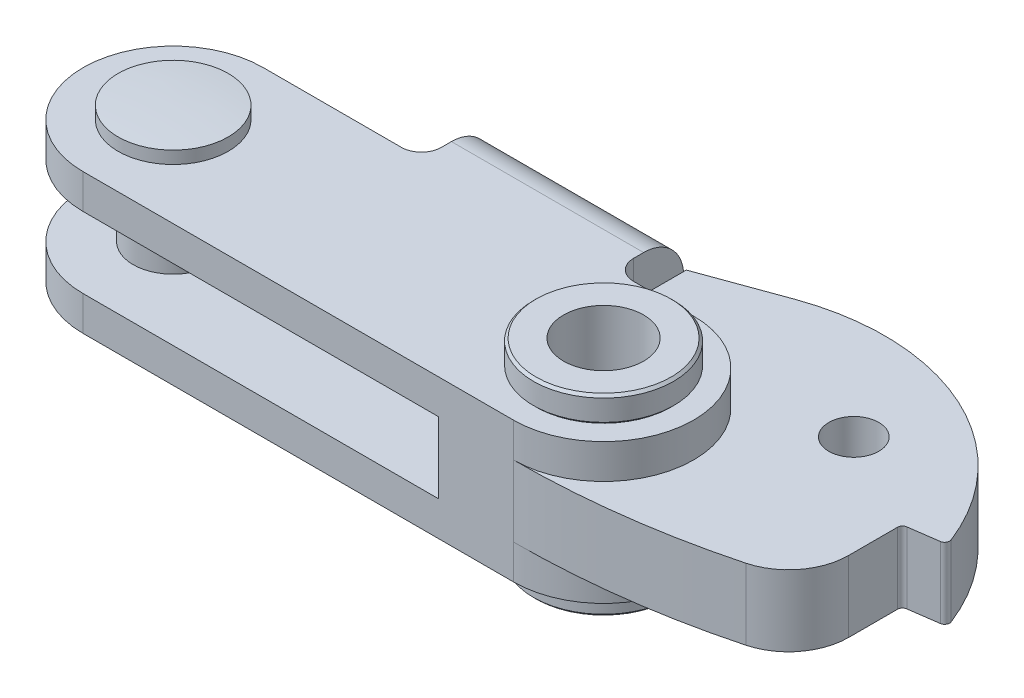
ISO-10303-21;
HEADER;
FILE_DESCRIPTION(('STEP AP214'),'2;1');
FILE_NAME('part.step','',(''),(''),'','','');
FILE_SCHEMA(('AUTOMOTIVE_DESIGN { 1 0 10303 214 1 1 1 1 }'));
ENDSEC;
DATA;
#1=APPLICATION_CONTEXT('core data for automotive mechanical design processes');
#2=APPLICATION_PROTOCOL_DEFINITION('international standard','automotive_design',2000,#1);
#3=PRODUCT_CONTEXT('',#1,'mechanical');
#4=PRODUCT('Part','Part','',(#3));
#5=PRODUCT_RELATED_PRODUCT_CATEGORY('part','',(#4));
#6=PRODUCT_DEFINITION_FORMATION('','',#4);
#7=PRODUCT_DEFINITION_CONTEXT('part definition',#1,'design');
#8=PRODUCT_DEFINITION('design','',#6,#7);
#9=PRODUCT_DEFINITION_SHAPE('','',#8);
#10=(LENGTH_UNIT() NAMED_UNIT(*) SI_UNIT(.MILLI.,.METRE.));
#11=(NAMED_UNIT(*) PLANE_ANGLE_UNIT() SI_UNIT($,.RADIAN.));
#12=(NAMED_UNIT(*) SI_UNIT($,.STERADIAN.) SOLID_ANGLE_UNIT());
#13=UNCERTAINTY_MEASURE_WITH_UNIT(LENGTH_MEASURE(1.E-05),#10,'distance_accuracy_value','');
#14=(GEOMETRIC_REPRESENTATION_CONTEXT(3) GLOBAL_UNCERTAINTY_ASSIGNED_CONTEXT((#13)) GLOBAL_UNIT_ASSIGNED_CONTEXT((#10,
#11,#12)) REPRESENTATION_CONTEXT('',''));
#15=CARTESIAN_POINT('',(0.,0.,0.));
#16=DIRECTION('',(0.,0.,1.));
#17=DIRECTION('',(1.,0.,0.));
#18=AXIS2_PLACEMENT_3D('',#15,#16,#17);
#19=CARTESIAN_POINT('',(0.,-7.,0.));
#20=DIRECTION('',(0.,1.,0.));
#21=DIRECTION('',(0.,0.,1.));
#22=AXIS2_PLACEMENT_3D('',#19,#20,#21);
#23=CYLINDRICAL_SURFACE('',#22,9.);
#24=DIRECTION('',(0.,1.,0.));
#25=VECTOR('',#24,1.);
#26=CARTESIAN_POINT('',(0.,-7.,-9.));
#27=LINE('',#26,#25);
#28=CARTESIAN_POINT('',(0.,3.55,-9.));
#29=VERTEX_POINT('',#28);
#30=CARTESIAN_POINT('',(0.,7.,-9.));
#31=VERTEX_POINT('',#30);
#32=EDGE_CURVE('E550',#29,#31,#27,.T.);
#33=ORIENTED_EDGE('',*,*,#32,.F.);
#34=CARTESIAN_POINT('',(0.,3.55,0.));
#35=DIRECTION('',(0.,-1.,0.));
#36=DIRECTION('',(1.,0.,0.));
#37=AXIS2_PLACEMENT_3D('',#34,#35,#36);
#38=CIRCLE('',#37,9.);
#39=CARTESIAN_POINT('',(0.,3.55,9.));
#40=VERTEX_POINT('',#39);
#41=EDGE_CURVE('E397',#40,#29,#38,.T.);
#42=ORIENTED_EDGE('',*,*,#41,.F.);
#43=DIRECTION('',(0.,1.,0.));
#44=VECTOR('',#43,1.);
#45=CARTESIAN_POINT('',(0.,-7.,9.));
#46=LINE('',#45,#44);
#47=CARTESIAN_POINT('',(0.,7.,9.));
#48=VERTEX_POINT('',#47);
#49=EDGE_CURVE('E546',#40,#48,#46,.T.);
#50=ORIENTED_EDGE('',*,*,#49,.T.);
#51=CARTESIAN_POINT('',(0.,7.,0.));
#52=DIRECTION('',(0.,1.,0.));
#53=DIRECTION('',(0.,0.,-1.));
#54=AXIS2_PLACEMENT_3D('',#51,#52,#53);
#55=CIRCLE('',#54,9.);
#56=EDGE_CURVE('E494',#31,#48,#55,.T.);
#57=ORIENTED_EDGE('',*,*,#56,.F.);
#58=EDGE_LOOP('',(#33,#42,#50,#57));
#59=FACE_BOUND('',#58,.T.);
#60=ADVANCED_FACE('F14',(#59),#23,.T.);
#61=CARTESIAN_POINT('',(13.8,-7.,-9.));
#62=DIRECTION('',(0.,0.,-1.));
#63=DIRECTION('',(0.,1.,0.));
#64=AXIS2_PLACEMENT_3D('',#61,#62,#63);
#65=PLANE('',#64);
#66=DIRECTION('',(0.,1.,0.));
#67=VECTOR('',#66,1.);
#68=CARTESIAN_POINT('',(13.7999999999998,-7.,-9.));
#69=LINE('',#68,#67);
#70=CARTESIAN_POINT('',(13.7999999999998,3.55,-9.));
#71=VERTEX_POINT('',#70);
#72=CARTESIAN_POINT('',(13.7999999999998,7.,-9.));
#73=VERTEX_POINT('',#72);
#74=EDGE_CURVE('E554',#71,#73,#69,.T.);
#75=ORIENTED_EDGE('',*,*,#74,.F.);
#76=DIRECTION('',(1.,0.,0.));
#77=VECTOR('',#76,1.);
#78=CARTESIAN_POINT('',(0.,3.55,-9.));
#79=LINE('',#78,#77);
#80=EDGE_CURVE('E399',#29,#71,#79,.T.);
#81=ORIENTED_EDGE('',*,*,#80,.F.);
#82=ORIENTED_EDGE('',*,*,#32,.T.);
#83=DIRECTION('',(-1.,0.,0.));
#84=VECTOR('',#83,1.);
#85=CARTESIAN_POINT('',(13.8,7.,-9.));
#86=LINE('',#85,#84);
#87=EDGE_CURVE('E491',#73,#31,#86,.T.);
#88=ORIENTED_EDGE('',*,*,#87,.F.);
#89=EDGE_LOOP('',(#75,#81,#82,#88));
#90=FACE_BOUND('',#89,.T.);
#91=ADVANCED_FACE('F649',(#90),#65,.T.);
#92=CARTESIAN_POINT('',(13.7999999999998,-7.,-11.0000000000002));
#93=DIRECTION('',(0.,1.,0.));
#94=DIRECTION('',(0.,0.,1.));
#95=AXIS2_PLACEMENT_3D('',#92,#93,#94);
#96=CYLINDRICAL_SURFACE('',#95,2.00000000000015);
#97=DIRECTION('',(0.,1.,0.));
#98=VECTOR('',#97,1.);
#99=CARTESIAN_POINT('',(15.8,-7.,-11.));
#100=LINE('',#99,#98);
#101=CARTESIAN_POINT('',(15.8,3.55,-11.0000000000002));
#102=VERTEX_POINT('',#101);
#103=CARTESIAN_POINT('',(15.8,7.,-11.));
#104=VERTEX_POINT('',#103);
#105=EDGE_CURVE('E558',#102,#104,#100,.T.);
#106=ORIENTED_EDGE('',*,*,#105,.F.);
#107=CARTESIAN_POINT('',(13.7999999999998,3.55,-11.0000000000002));
#108=DIRECTION('',(0.,1.,0.));
#109=DIRECTION('',(1.,0.,0.));
#110=AXIS2_PLACEMENT_3D('',#107,#108,#109);
#111=CIRCLE('',#110,2.00000000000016);
#112=EDGE_CURVE('E401',#71,#102,#111,.T.);
#113=ORIENTED_EDGE('',*,*,#112,.F.);
#114=ORIENTED_EDGE('',*,*,#74,.T.);
#115=CARTESIAN_POINT('',(13.7999999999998,7.,-11.0000000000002));
#116=DIRECTION('',(0.,-1.,0.));
#117=DIRECTION('',(0.,0.,-1.));
#118=AXIS2_PLACEMENT_3D('',#115,#116,#117);
#119=CIRCLE('',#118,2.00000000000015);
#120=EDGE_CURVE('E488',#104,#73,#119,.T.);
#121=ORIENTED_EDGE('',*,*,#120,.F.);
#122=EDGE_LOOP('',(#106,#113,#114,#121));
#123=FACE_BOUND('',#122,.T.);
#124=ADVANCED_FACE('F657',(#123),#96,.F.);
#125=CARTESIAN_POINT('',(13.7999999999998,-7.,-9.));
#126=VERTEX_POINT('',#125);
#127=CARTESIAN_POINT('',(13.7999999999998,-3.55,-9.));
#128=VERTEX_POINT('',#127);
#129=EDGE_CURVE('E555',#126,#128,#69,.T.);
#130=ORIENTED_EDGE('',*,*,#129,.T.);
#131=CARTESIAN_POINT('',(13.7999999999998,-3.55,-11.0000000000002));
#132=DIRECTION('',(0.,-1.,0.));
#133=DIRECTION('',(0.,0.,1.));
#134=AXIS2_PLACEMENT_3D('',#131,#132,#133);
#135=CIRCLE('',#134,2.00000000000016);
#136=CARTESIAN_POINT('',(15.8,-3.55,-11.));
#137=VERTEX_POINT('',#136);
#138=EDGE_CURVE('E424',#137,#128,#135,.T.);
#139=ORIENTED_EDGE('',*,*,#138,.F.);
#140=CARTESIAN_POINT('',(15.8,-7.,-11.));
#141=VERTEX_POINT('',#140);
#142=EDGE_CURVE('E559',#141,#137,#100,.T.);
#143=ORIENTED_EDGE('',*,*,#142,.F.);
#144=CARTESIAN_POINT('',(13.7999999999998,-7.,-11.0000000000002));
#145=DIRECTION('',(0.,-1.,0.));
#146=DIRECTION('',(0.,0.,-1.));
#147=AXIS2_PLACEMENT_3D('',#144,#145,#146);
#148=CIRCLE('',#147,2.00000000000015);
#149=EDGE_CURVE('E514',#141,#126,#148,.T.);
#150=ORIENTED_EDGE('',*,*,#149,.T.);
#151=EDGE_LOOP('',(#130,#139,#143,#150));
#152=FACE_BOUND('',#151,.T.);
#153=ADVANCED_FACE('F675',(#152),#96,.F.);
#154=CARTESIAN_POINT('',(0.,-7.,-9.));
#155=VERTEX_POINT('',#154);
#156=CARTESIAN_POINT('',(0.,-3.55,-9.));
#157=VERTEX_POINT('',#156);
#158=EDGE_CURVE('E551',#155,#157,#27,.T.);
#159=ORIENTED_EDGE('',*,*,#158,.T.);
#160=DIRECTION('',(-1.,0.,0.));
#161=VECTOR('',#160,1.);
#162=CARTESIAN_POINT('',(13.7999999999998,-3.55,-9.));
#163=LINE('',#162,#161);
#164=EDGE_CURVE('E426',#128,#157,#163,.T.);
#165=ORIENTED_EDGE('',*,*,#164,.F.);
#166=ORIENTED_EDGE('',*,*,#129,.F.);
#167=DIRECTION('',(-1.,0.,0.));
#168=VECTOR('',#167,1.);
#169=CARTESIAN_POINT('',(13.8,-7.,-9.));
#170=LINE('',#169,#168);
#171=EDGE_CURVE('E517',#126,#155,#170,.T.);
#172=ORIENTED_EDGE('',*,*,#171,.T.);
#173=EDGE_LOOP('',(#159,#165,#166,#172));
#174=FACE_BOUND('',#173,.T.);
#175=ADVANCED_FACE('F660',(#174),#65,.T.);
#176=CARTESIAN_POINT('',(0.,-7.,9.));
#177=VERTEX_POINT('',#176);
#178=CARTESIAN_POINT('',(0.,-3.55,9.));
#179=VERTEX_POINT('',#178);
#180=EDGE_CURVE('E547',#177,#179,#46,.T.);
#181=ORIENTED_EDGE('',*,*,#180,.T.);
#182=CARTESIAN_POINT('',(0.,-3.55,0.));
#183=DIRECTION('',(0.,1.,0.));
#184=DIRECTION('',(0.,0.,1.));
#185=AXIS2_PLACEMENT_3D('',#182,#183,#184);
#186=CIRCLE('',#185,9.);
#187=EDGE_CURVE('E428',#157,#179,#186,.T.);
#188=ORIENTED_EDGE('',*,*,#187,.F.);
#189=ORIENTED_EDGE('',*,*,#158,.F.);
#190=CARTESIAN_POINT('',(0.,-7.,0.));
#191=DIRECTION('',(0.,1.,0.));
#192=DIRECTION('',(0.,0.,-1.));
#193=AXIS2_PLACEMENT_3D('',#190,#191,#192);
#194=CIRCLE('',#193,9.);
#195=EDGE_CURVE('E520',#155,#177,#194,.T.);
#196=ORIENTED_EDGE('',*,*,#195,.T.);
#197=EDGE_LOOP('',(#181,#188,#189,#196));
#198=FACE_BOUND('',#197,.T.);
#199=ADVANCED_FACE('F652',(#198),#23,.T.);
#200=CARTESIAN_POINT('',(43.,-9.7,0.));
#201=DIRECTION('',(0.,1.,0.));
#202=DIRECTION('',(0.,0.,-1.));
#203=AXIS2_PLACEMENT_3D('',#200,#201,#202);
#204=CYLINDRICAL_SURFACE('',#203,4.);
#205=CARTESIAN_POINT('',(43.,-9.6,0.));
#206=DIRECTION('',(0.,-1.,0.));
#207=DIRECTION('',(0.,0.,-1.));
#208=AXIS2_PLACEMENT_3D('',#205,#206,#207);
#209=CIRCLE('',#208,4.);
#210=CARTESIAN_POINT('',(43.,-9.6,-4.));
#211=VERTEX_POINT('',#210);
#212=EDGE_CURVE('E1663',#211,#211,#209,.T.);
#213=ORIENTED_EDGE('',*,*,#212,.T.);
#214=EDGE_LOOP('',(#213));
#215=FACE_BOUND('',#214,.T.);
#216=CARTESIAN_POINT('',(43.,9.6,0.));
#217=DIRECTION('',(0.,1.,0.));
#218=DIRECTION('',(0.,0.,1.));
#219=AXIS2_PLACEMENT_3D('',#216,#217,#218);
#220=CIRCLE('',#219,4.);
#221=CARTESIAN_POINT('',(43.,9.6,4.));
#222=VERTEX_POINT('',#221);
#223=EDGE_CURVE('E1664',#222,#222,#220,.T.);
#224=ORIENTED_EDGE('',*,*,#223,.T.);
#225=EDGE_LOOP('',(#224));
#226=FACE_BOUND('',#225,.T.);
#227=ADVANCED_FACE('F664',(#215,#226),#204,.F.);
#228=CARTESIAN_POINT('',(0.,-4.4122867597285,0.));
#229=DIRECTION('',(0.,1.,0.));
#230=DIRECTION('',(1.,0.,0.));
#231=AXIS2_PLACEMENT_3D('',#228,#229,#230);
#232=CYLINDRICAL_SURFACE('',#231,5.5);
#233=CARTESIAN_POINT('',(0.,7.,0.));
#234=DIRECTION('',(0.,1.,0.));
#235=DIRECTION('',(1.,0.,0.));
#236=AXIS2_PLACEMENT_3D('',#233,#234,#235);
#237=CIRCLE('',#236,5.5);
#238=CARTESIAN_POINT('',(5.5,7.,0.));
#239=VERTEX_POINT('',#238);
#240=EDGE_CURVE('E609',#239,#239,#237,.T.);
#241=ORIENTED_EDGE('',*,*,#240,.T.);
#242=EDGE_LOOP('',(#241));
#243=FACE_BOUND('',#242,.T.);
#244=CARTESIAN_POINT('',(0.,8.2473848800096,0.));
#245=DIRECTION('',(0.,1.,0.));
#246=DIRECTION('',(1.,0.,0.));
#247=AXIS2_PLACEMENT_3D('',#244,#245,#246);
#248=CIRCLE('',#247,5.5);
#249=CARTESIAN_POINT('',(5.5,8.2473848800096,0.));
#250=VERTEX_POINT('',#249);
#251=EDGE_CURVE('E612',#250,#250,#248,.T.);
#252=ORIENTED_EDGE('',*,*,#251,.F.);
#253=EDGE_LOOP('',(#252));
#254=FACE_BOUND('',#253,.T.);
#255=ADVANCED_FACE('F671',(#243,#254),#232,.T.);
#256=CARTESIAN_POINT('',(-2.12462869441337E-12,-51.4999999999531,0.));
#257=DIRECTION('',(0.,1.,0.));
#258=DIRECTION('',(1.,0.,0.));
#259=AXIS2_PLACEMENT_3D('',#256,#257,#258);
#260=SPHERICAL_SURFACE('',#259,59.9999999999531);
#261=ORIENTED_EDGE('',*,*,#251,.T.);
#262=EDGE_LOOP('',(#261));
#263=FACE_BOUND('',#262,.T.);
#264=ADVANCED_FACE('F811',(#263),#260,.T.);
#265=CARTESIAN_POINT('',(0.,-4.4122867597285,0.));
#266=DIRECTION('',(0.,1.,0.));
#267=DIRECTION('',(1.,0.,0.));
#268=AXIS2_PLACEMENT_3D('',#265,#266,#267);
#269=CYLINDRICAL_SURFACE('',#268,5.5);
#270=CARTESIAN_POINT('',(0.,-8.2473848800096,0.));
#271=DIRECTION('',(0.,1.,0.));
#272=DIRECTION('',(1.,0.,0.));
#273=AXIS2_PLACEMENT_3D('',#270,#271,#272);
#274=CIRCLE('',#273,5.5);
#275=CARTESIAN_POINT('',(-5.4999999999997,-8.2473848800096,0.));
#276=VERTEX_POINT('',#275);
#277=EDGE_CURVE('E620',#276,#276,#274,.T.);
#278=ORIENTED_EDGE('',*,*,#277,.T.);
#279=EDGE_LOOP('',(#278));
#280=FACE_BOUND('',#279,.T.);
#281=CARTESIAN_POINT('',(0.,-7.,0.));
#282=DIRECTION('',(0.,-1.,0.));
#283=DIRECTION('',(0.,0.,-1.));
#284=AXIS2_PLACEMENT_3D('',#281,#282,#283);
#285=CIRCLE('',#284,5.5);
#286=CARTESIAN_POINT('',(0.,-7.,-5.5));
#287=VERTEX_POINT('',#286);
#288=EDGE_CURVE('E573',#287,#287,#285,.T.);
#289=ORIENTED_EDGE('',*,*,#288,.T.);
#290=EDGE_LOOP('',(#289));
#291=FACE_BOUND('',#290,.T.);
#292=ADVANCED_FACE('F822',(#280,#291),#269,.T.);
#293=CARTESIAN_POINT('',(5.44649890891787E-12,51.5000000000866,0.));
#294=DIRECTION('',(0.,1.,0.));
#295=DIRECTION('',(-1.,0.,0.));
#296=AXIS2_PLACEMENT_3D('',#293,#294,#295);
#297=SPHERICAL_SURFACE('',#296,60.0000000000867);
#298=CARTESIAN_POINT('',(0.,-8.4369460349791,0.));
#299=DIRECTION('',(0.,1.,0.));
#300=DIRECTION('',(1.,0.,0.));
#301=AXIS2_PLACEMENT_3D('',#298,#299,#300);
#302=CIRCLE('',#301,2.75);
#303=CARTESIAN_POINT('',(-2.74999999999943,-8.4369460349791,0.));
#304=VERTEX_POINT('',#303);
#305=EDGE_CURVE('E617',#304,#304,#302,.T.);
#306=CARTESIAN_POINT('',(-2.74999999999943,-8.4369460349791,0.));
#307=CARTESIAN_POINT('',(-2.77868615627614,-8.43562986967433,0.));
#308=CARTESIAN_POINT('',(-2.80737136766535,-8.43429311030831,0.));
#309=CARTESIAN_POINT('',(-2.8647398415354,-8.43157840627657,0.));
#310=CARTESIAN_POINT('',(-2.89342310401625,-8.43020046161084,0.));
#311=CARTESIAN_POINT('',(-2.95078762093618,-8.42740338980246,0.));
#312=CARTESIAN_POINT('',(-2.97946887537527,-8.42598426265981,0.));
#313=CARTESIAN_POINT('',(-3.03682931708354,-8.42310482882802,0.));
#314=CARTESIAN_POINT('',(-3.06550850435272,-8.42164452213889,0.));
#315=CARTESIAN_POINT('',(-3.12286475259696,-8.41868273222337,0.));
#316=CARTESIAN_POINT('',(-3.15154181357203,-8.41718124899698,0.));
#317=CARTESIAN_POINT('',(-3.20889375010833,-8.41413710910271,0.));
#318=CARTESIAN_POINT('',(-3.23756862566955,-8.41259445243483,0.));
#319=CARTESIAN_POINT('',(-3.29491613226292,-8.40946796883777,0.));
#320=CARTESIAN_POINT('',(-3.32358876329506,-8.4078841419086,0.));
#321=CARTESIAN_POINT('',(-3.38093172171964,-8.40467532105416,0.));
#322=CARTESIAN_POINT('',(-3.40960204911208,-8.40305032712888,0.));
#323=CARTESIAN_POINT('',(-3.46694034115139,-8.39975917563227,0.));
#324=CARTESIAN_POINT('',(-3.49560830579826,-8.39809301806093,0.));
#325=CARTESIAN_POINT('',(-3.55294181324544,-8.39471954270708,0.));
#326=CARTESIAN_POINT('',(-3.58160735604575,-8.39301222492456,0.));
#327=CARTESIAN_POINT('',(-3.6389359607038,-8.38955643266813,0.));
#328=CARTESIAN_POINT('',(-3.66759902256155,-8.38780795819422,0.));
#329=CARTESIAN_POINT('',(-3.72492260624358,-8.38426985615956,0.));
#330=CARTESIAN_POINT('',(-3.75358312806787,-8.38248022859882,0.));
#331=CARTESIAN_POINT('',(-3.81090157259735,-8.37885982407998,0.));
#332=CARTESIAN_POINT('',(-3.83955949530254,-8.37702904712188,0.));
#333=CARTESIAN_POINT('',(-3.89687268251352,-8.37332634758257,0.));
#334=CARTESIAN_POINT('',(-3.92552794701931,-8.37145442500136,0.));
#335=CARTESIAN_POINT('',(-3.98283575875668,-8.36766943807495,0.));
#336=CARTESIAN_POINT('',(-4.01148830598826,-8.36575637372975,0.));
#337=CARTESIAN_POINT('',(-4.068790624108,-8.36188910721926,0.));
#338=CARTESIAN_POINT('',(-4.09744039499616,-8.35993490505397,0.));
#339=CARTESIAN_POINT('',(-4.15473710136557,-8.35598536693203,0.));
#340=CARTESIAN_POINT('',(-4.18338403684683,-8.35399003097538,0.));
#341=CARTESIAN_POINT('',(-4.24067501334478,-8.34995822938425,0.));
#342=CARTESIAN_POINT('',(-4.26931905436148,-8.34792176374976,0.));
#343=CARTESIAN_POINT('',(-4.32660418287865,-8.34380770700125,0.));
#344=CARTESIAN_POINT('',(-4.35524527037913,-8.34173011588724,0.));
#345=CARTESIAN_POINT('',(-4.41252443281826,-8.33753381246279,0.));
#346=CARTESIAN_POINT('',(-4.44116250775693,-8.33541510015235,0.));
#347=CARTESIAN_POINT('',(-4.49843558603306,-8.33113655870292,0.));
#348=CARTESIAN_POINT('',(-4.52707058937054,-8.32897672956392,0.));
#349=CARTESIAN_POINT('',(-4.58433746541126,-8.32461595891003,0.));
#350=CARTESIAN_POINT('',(-4.6129693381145,-8.32241501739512,0.));
#351=CARTESIAN_POINT('',(-4.67022989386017,-8.31797202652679,0.));
#352=CARTESIAN_POINT('',(-4.6988585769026,-8.31572997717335,0.));
#353=CARTESIAN_POINT('',(-4.75611269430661,-8.31120477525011,0.));
#354=CARTESIAN_POINT('',(-4.7847381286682,-8.3089216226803,0.));
#355=CARTESIAN_POINT('',(-4.84198568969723,-8.30431421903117,0.));
#356=CARTESIAN_POINT('',(-4.87060781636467,-8.30198996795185,0.));
#357=CARTESIAN_POINT('',(-4.92784870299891,-8.29730037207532,0.));
#358=CARTESIAN_POINT('',(-4.95646746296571,-8.29493502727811,0.));
#359=CARTESIAN_POINT('',(-5.0137015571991,-8.29016324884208,0.));
#360=CARTESIAN_POINT('',(-5.04231689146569,-8.28775681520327,0.));
#361=CARTESIAN_POINT('',(-5.09954407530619,-8.28290286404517,0.));
#362=CARTESIAN_POINT('',(-5.12815592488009,-8.28045534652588,0.));
#363=CARTESIAN_POINT('',(-5.18537608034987,-8.27551923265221,0.));
#364=CARTESIAN_POINT('',(-5.21398438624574,-8.27303063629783,0.));
#365=CARTESIAN_POINT('',(-5.27119739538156,-8.26801236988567,0.));
#366=CARTESIAN_POINT('',(-5.29980209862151,-8.26548269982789,0.));
#367=CARTESIAN_POINT('',(-5.35700784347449,-8.26038229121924,0.));
#368=CARTESIAN_POINT('',(-5.38560888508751,-8.25781155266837,0.));
#369=CARTESIAN_POINT('',(-5.44280724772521,-8.25262901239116,0.));
#370=CARTESIAN_POINT('',(-5.47140456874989,-8.25001721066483,0.));
#371=CARTESIAN_POINT('',(-5.4999999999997,-8.2473848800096,0.));
#372=B_SPLINE_CURVE_WITH_KNOTS('',3,(#306,#307,#308,#309,#310,#311,#312,#313,#314,#315,#316,
#317,#318,#319,#320,#321,#322,#323,#324,#325,#326,#327,#328,#329,#330,#331,#332,#333,#334,#335,
#336,#337,#338,#339,#340,#341,#342,#343,#344,#345,#346,#347,#348,#349,#350,#351,#352,#353,#354,
#355,#356,#357,#358,#359,#360,#361,#362,#363,#364,#365,#366,#367,#368,#369,#370,#371),
.UNSPECIFIED.,.F.,.F.,(4,2,2,2,2,2,2,2,2,2,2,2,2,2,2,2,2,2,2,2,2,2,2,2,2,2,2,2,2,2,2,2,4),(0.,
0.086148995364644,0.172297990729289,0.258446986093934,0.344595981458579,0.430744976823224,
0.516893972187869,0.603042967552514,0.689191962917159,0.775340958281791,0.861489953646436,
0.947638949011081,1.03378794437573,1.11993693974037,1.20608593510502,1.29223493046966,
1.37838392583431,1.46453292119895,1.5506819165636,1.63683091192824,1.72297990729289,
1.80912890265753,1.89527789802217,1.98142689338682,2.06757588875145,2.1537248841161,
2.23987387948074,2.32602287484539,2.41217187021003,2.49832086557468,2.58446986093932,
2.67061885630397,2.75676785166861),.UNSPECIFIED.);
#373=EDGE_CURVE('BSEAM830',#304,#276,#372,.T.);
#374=ORIENTED_EDGE('',*,*,#305,.T.);
#375=ORIENTED_EDGE('',*,*,#277,.F.);
#376=ORIENTED_EDGE('',*,*,#373,.T.);
#377=ORIENTED_EDGE('',*,*,#373,.F.);
#378=EDGE_LOOP('',(#374,#376,#375,#377));
#379=FACE_BOUND('',#378,.T.);
#380=ADVANCED_FACE('F830',(#379),#297,.T.);
#381=CARTESIAN_POINT('',(0.,-4.4122867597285,0.));
#382=DIRECTION('',(0.,1.,0.));
#383=DIRECTION('',(1.,0.,0.));
#384=AXIS2_PLACEMENT_3D('',#381,#382,#383);
#385=CYLINDRICAL_SURFACE('',#384,2.75);
#386=CARTESIAN_POINT('',(0.,-6.,0.));
#387=DIRECTION('',(0.,1.,0.));
#388=DIRECTION('',(1.,0.,0.));
#389=AXIS2_PLACEMENT_3D('',#386,#387,#388);
#390=CIRCLE('',#389,2.75);
#391=CARTESIAN_POINT('',(2.75,-6.,0.));
#392=VERTEX_POINT('',#391);
#393=EDGE_CURVE('E434',#392,#392,#390,.T.);
#394=ORIENTED_EDGE('',*,*,#393,.T.);
#395=EDGE_LOOP('',(#394));
#396=FACE_BOUND('',#395,.T.);
#397=ORIENTED_EDGE('',*,*,#305,.F.);
#398=EDGE_LOOP('',(#397));
#399=FACE_BOUND('',#398,.T.);
#400=ADVANCED_FACE('F846',(#396,#399),#385,.F.);
#401=CARTESIAN_POINT('',(0.,-6.,0.));
#402=DIRECTION('',(0.,-1.,0.));
#403=DIRECTION('',(-1.,0.,0.));
#404=AXIS2_PLACEMENT_3D('',#401,#402,#403);
#405=CONICAL_SURFACE('',#404,2.75,1.04719755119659);
#406=CARTESIAN_POINT('',(0.,-4.4122867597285,0.));
#407=VERTEX_POINT('',#406);
#408=VERTEX_LOOP('',#407);
#409=FACE_BOUND('',#408,.T.);
#410=ORIENTED_EDGE('',*,*,#393,.F.);
#411=EDGE_LOOP('',(#410));
#412=FACE_BOUND('',#411,.T.);
#413=ADVANCED_FACE('F841',(#409,#412),#405,.F.);
#414=CARTESIAN_POINT('',(0.,-4.4122867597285,0.));
#415=DIRECTION('',(0.,1.,0.));
#416=DIRECTION('',(1.,0.,0.));
#417=AXIS2_PLACEMENT_3D('',#414,#415,#416);
#418=CYLINDRICAL_SURFACE('',#417,4.);
#419=CARTESIAN_POINT('',(0.,-3.55,0.));
#420=DIRECTION('',(0.,1.,0.));
#421=DIRECTION('',(0.,0.,1.));
#422=AXIS2_PLACEMENT_3D('',#419,#420,#421);
#423=CIRCLE('',#422,4.);
#424=CARTESIAN_POINT('',(0.,-3.55,4.));
#425=VERTEX_POINT('',#424);
#426=EDGE_CURVE('E406',#425,#425,#423,.T.);
#427=ORIENTED_EDGE('',*,*,#426,.T.);
#428=EDGE_LOOP('',(#427));
#429=FACE_BOUND('',#428,.T.);
#430=CARTESIAN_POINT('',(0.,3.55,0.));
#431=DIRECTION('',(0.,-1.,0.));
#432=DIRECTION('',(1.,0.,0.));
#433=AXIS2_PLACEMENT_3D('',#430,#431,#432);
#434=CIRCLE('',#433,4.);
#435=CARTESIAN_POINT('',(4.,3.55,0.));
#436=VERTEX_POINT('',#435);
#437=EDGE_CURVE('E380',#436,#436,#434,.T.);
#438=ORIENTED_EDGE('',*,*,#437,.T.);
#439=EDGE_LOOP('',(#438));
#440=FACE_BOUND('',#439,.T.);
#441=ADVANCED_FACE('F838',(#429,#440),#418,.T.);
#442=CARTESIAN_POINT('',(43.,-7.,0.));
#443=DIRECTION('',(0.,-1.,0.));
#444=DIRECTION('',(0.,0.,1.));
#445=AXIS2_PLACEMENT_3D('',#442,#443,#444);
#446=CONICAL_SURFACE('',#445,6.8,0.785398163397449);
#447=CARTESIAN_POINT('',(43.,-7.2,0.));
#448=DIRECTION('',(0.,-1.,0.));
#449=DIRECTION('',(0.,0.,1.));
#450=AXIS2_PLACEMENT_3D('',#447,#448,#449);
#451=CIRCLE('',#450,7.);
#452=CARTESIAN_POINT('',(43.,-7.2,7.));
#453=VERTEX_POINT('',#452);
#454=EDGE_CURVE('E604',#453,#453,#451,.T.);
#455=ORIENTED_EDGE('',*,*,#454,.F.);
#456=EDGE_LOOP('',(#455));
#457=FACE_BOUND('',#456,.T.);
#458=CARTESIAN_POINT('',(43.,-7.,0.));
#459=DIRECTION('',(0.,-1.,0.));
#460=DIRECTION('',(0.,0.,1.));
#461=AXIS2_PLACEMENT_3D('',#458,#459,#460);
#462=CIRCLE('',#461,6.8);
#463=CARTESIAN_POINT('',(43.,-7.,6.8));
#464=VERTEX_POINT('',#463);
#465=EDGE_CURVE('E576',#464,#464,#462,.T.);
#466=ORIENTED_EDGE('',*,*,#465,.T.);
#467=EDGE_LOOP('',(#466));
#468=FACE_BOUND('',#467,.T.);
#469=ADVANCED_FACE('F840',(#457,#468),#446,.T.);
#470=CARTESIAN_POINT('',(43.,-7.,0.));
#471=DIRECTION('',(0.,-1.,0.));
#472=DIRECTION('',(0.,0.,1.));
#473=AXIS2_PLACEMENT_3D('',#470,#471,#472);
#474=CYLINDRICAL_SURFACE('',#473,7.);
#475=CARTESIAN_POINT('',(43.,-9.35,0.));
#476=DIRECTION('',(0.,-1.,0.));
#477=DIRECTION('',(0.,0.,-1.));
#478=AXIS2_PLACEMENT_3D('',#475,#476,#477);
#479=CIRCLE('',#478,7.);
#480=CARTESIAN_POINT('',(43.,-9.35,-7.));
#481=VERTEX_POINT('',#480);
#482=EDGE_CURVE('E629',#481,#481,#479,.F.);
#483=ORIENTED_EDGE('',*,*,#482,.T.);
#484=EDGE_LOOP('',(#483));
#485=FACE_BOUND('',#484,.T.);
#486=ORIENTED_EDGE('',*,*,#454,.T.);
#487=EDGE_LOOP('',(#486));
#488=FACE_BOUND('',#487,.T.);
#489=ADVANCED_FACE('F833',(#485,#488),#474,.T.);
#490=CARTESIAN_POINT('',(43.,7.,0.));
#491=DIRECTION('',(0.,1.,0.));
#492=DIRECTION('',(0.,0.,-1.));
#493=AXIS2_PLACEMENT_3D('',#490,#491,#492);
#494=CONICAL_SURFACE('',#493,6.75,0.785398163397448);
#495=CARTESIAN_POINT('',(43.,7.25,0.));
#496=DIRECTION('',(0.,1.,0.));
#497=DIRECTION('',(0.,0.,-1.));
#498=AXIS2_PLACEMENT_3D('',#495,#496,#497);
#499=CIRCLE('',#498,7.);
#500=CARTESIAN_POINT('',(43.,7.25,-7.));
#501=VERTEX_POINT('',#500);
#502=EDGE_CURVE('E580',#501,#501,#499,.T.);
#503=ORIENTED_EDGE('',*,*,#502,.F.);
#504=EDGE_LOOP('',(#503));
#505=FACE_BOUND('',#504,.T.);
#506=CARTESIAN_POINT('',(43.,7.,0.));
#507=DIRECTION('',(0.,1.,0.));
#508=DIRECTION('',(0.,0.,-1.));
#509=AXIS2_PLACEMENT_3D('',#506,#507,#508);
#510=CIRCLE('',#509,6.75);
#511=CARTESIAN_POINT('',(43.,7.,-6.75));
#512=VERTEX_POINT('',#511);
#513=EDGE_CURVE('E605',#512,#512,#510,.T.);
#514=ORIENTED_EDGE('',*,*,#513,.T.);
#515=EDGE_LOOP('',(#514));
#516=FACE_BOUND('',#515,.T.);
#517=ADVANCED_FACE('F857',(#505,#516),#494,.T.);
#518=CARTESIAN_POINT('',(43.,-9.7,0.));
#519=DIRECTION('',(0.,1.,0.));
#520=DIRECTION('',(0.,0.,-1.));
#521=AXIS2_PLACEMENT_3D('',#518,#519,#520);
#522=CYLINDRICAL_SURFACE('',#521,7.);
#523=CARTESIAN_POINT('',(43.,9.35,0.));
#524=DIRECTION('',(0.,1.,0.));
#525=DIRECTION('',(0.,0.,1.));
#526=AXIS2_PLACEMENT_3D('',#523,#524,#525);
#527=CIRCLE('',#526,7.);
#528=CARTESIAN_POINT('',(43.,9.35,7.));
#529=VERTEX_POINT('',#528);
#530=EDGE_CURVE('E9',#529,#529,#527,.F.);
#531=ORIENTED_EDGE('',*,*,#530,.T.);
#532=EDGE_LOOP('',(#531));
#533=FACE_BOUND('',#532,.T.);
#534=ORIENTED_EDGE('',*,*,#502,.T.);
#535=EDGE_LOOP('',(#534));
#536=FACE_BOUND('',#535,.T.);
#537=ADVANCED_FACE('F836',(#533,#536),#522,.T.);
#538=CARTESIAN_POINT('',(35.2,3.5,-12.));
#539=DIRECTION('',(0.,0.,1.));
#540=DIRECTION('',(0.,-1.,0.));
#541=AXIS2_PLACEMENT_3D('',#538,#539,#540);
#542=PLANE('',#541);
#543=DIRECTION('',(0.,-1.,0.));
#544=VECTOR('',#543,1.);
#545=CARTESIAN_POINT('',(35.2,3.5,-12.));
#546=LINE('',#545,#544);
#547=CARTESIAN_POINT('',(35.2,3.55,-12.));
#548=VERTEX_POINT('',#547);
#549=CARTESIAN_POINT('',(35.2,-3.55,-12.));
#550=VERTEX_POINT('',#549);
#551=EDGE_CURVE('E595',#548,#550,#546,.T.);
#552=ORIENTED_EDGE('',*,*,#551,.T.);
#553=DIRECTION('',(1.,0.,0.));
#554=VECTOR('',#553,1.);
#555=CARTESIAN_POINT('',(35.,-3.55,-12.));
#556=LINE('',#555,#554);
#557=CARTESIAN_POINT('',(35.,-3.55,-12.));
#558=VERTEX_POINT('',#557);
#559=EDGE_CURVE('E303',#558,#550,#556,.T.);
#560=ORIENTED_EDGE('',*,*,#559,.F.);
#561=DIRECTION('',(0.,1.,0.));
#562=VECTOR('',#561,1.);
#563=CARTESIAN_POINT('',(35.,-3.55,-12.));
#564=LINE('',#563,#562);
#565=CARTESIAN_POINT('',(35.,-3.5,-12.));
#566=VERTEX_POINT('',#565);
#567=EDGE_CURVE('E29',#558,#566,#564,.T.);
#568=ORIENTED_EDGE('',*,*,#567,.T.);
#569=DIRECTION('',(-1.,0.,0.));
#570=VECTOR('',#569,1.);
#571=CARTESIAN_POINT('',(54.,-3.5,-12.));
#572=LINE('',#571,#570);
#573=CARTESIAN_POINT('',(21.,-3.5,-12.));
#574=VERTEX_POINT('',#573);
#575=EDGE_CURVE('E465',#566,#574,#572,.T.);
#576=ORIENTED_EDGE('',*,*,#575,.T.);
#577=DIRECTION('',(0.,-1.,0.));
#578=VECTOR('',#577,1.);
#579=CARTESIAN_POINT('',(21.,3.5,-12.));
#580=LINE('',#579,#578);
#581=CARTESIAN_POINT('',(21.,3.5,-12.));
#582=VERTEX_POINT('',#581);
#583=EDGE_CURVE('E592',#582,#574,#580,.T.);
#584=ORIENTED_EDGE('',*,*,#583,.F.);
#585=DIRECTION('',(-1.,0.,0.));
#586=VECTOR('',#585,1.);
#587=CARTESIAN_POINT('',(54.,3.5,-12.));
#588=LINE('',#587,#586);
#589=CARTESIAN_POINT('',(35.,3.5,-12.));
#590=VERTEX_POINT('',#589);
#591=EDGE_CURVE('E470',#590,#582,#588,.T.);
#592=ORIENTED_EDGE('',*,*,#591,.F.);
#593=DIRECTION('',(0.,-1.,0.));
#594=VECTOR('',#593,1.);
#595=CARTESIAN_POINT('',(35.,3.55,-12.));
#596=LINE('',#595,#594);
#597=CARTESIAN_POINT('',(35.,3.55,-12.));
#598=VERTEX_POINT('',#597);
#599=EDGE_CURVE('E378',#598,#590,#596,.T.);
#600=ORIENTED_EDGE('',*,*,#599,.F.);
#601=DIRECTION('',(-1.,0.,0.));
#602=VECTOR('',#601,1.);
#603=CARTESIAN_POINT('',(35.2,3.55,-12.));
#604=LINE('',#603,#602);
#605=EDGE_CURVE('E336',#548,#598,#604,.T.);
#606=ORIENTED_EDGE('',*,*,#605,.F.);
#607=EDGE_LOOP('',(#552,#560,#568,#576,#584,#592,#600,#606));
#608=FACE_BOUND('',#607,.T.);
#609=ADVANCED_FACE('F737',(#608),#542,.F.);
#610=CARTESIAN_POINT('',(21.,3.5,-12.));
#611=DIRECTION('',(1.,0.,0.));
#612=DIRECTION('',(0.,1.,0.));
#613=AXIS2_PLACEMENT_3D('',#610,#611,#612);
#614=PLANE('',#613);
#615=ORIENTED_EDGE('',*,*,#583,.T.);
#616=DIRECTION('',(0.,1.,0.));
#617=VECTOR('',#616,1.);
#618=CARTESIAN_POINT('',(21.,-3.55,-12.));
#619=LINE('',#618,#617);
#620=CARTESIAN_POINT('',(21.,-3.55,-12.));
#621=VERTEX_POINT('',#620);
#622=EDGE_CURVE('E430',#621,#574,#619,.T.);
#623=ORIENTED_EDGE('',*,*,#622,.F.);
#624=DIRECTION('',(0.,0.,-1.));
#625=VECTOR('',#624,1.);
#626=CARTESIAN_POINT('',(21.,-3.55,-5.5));
#627=LINE('',#626,#625);
#628=CARTESIAN_POINT('',(21.,-3.55,-5.5));
#629=VERTEX_POINT('',#628);
#630=EDGE_CURVE('E416',#629,#621,#627,.T.);
#631=ORIENTED_EDGE('',*,*,#630,.F.);
#632=DIRECTION('',(0.,-1.,0.));
#633=VECTOR('',#632,1.);
#634=CARTESIAN_POINT('',(21.,3.5,-5.5));
#635=LINE('',#634,#633);
#636=CARTESIAN_POINT('',(21.,3.55,-5.5));
#637=VERTEX_POINT('',#636);
#638=EDGE_CURVE('E590',#637,#629,#635,.T.);
#639=ORIENTED_EDGE('',*,*,#638,.F.);
#640=DIRECTION('',(0.,0.,1.));
#641=VECTOR('',#640,1.);
#642=CARTESIAN_POINT('',(21.,3.55,-12.));
#643=LINE('',#642,#641);
#644=CARTESIAN_POINT('',(21.,3.55,-12.));
#645=VERTEX_POINT('',#644);
#646=EDGE_CURVE('E389',#645,#637,#643,.T.);
#647=ORIENTED_EDGE('',*,*,#646,.F.);
#648=DIRECTION('',(0.,-1.,0.));
#649=VECTOR('',#648,1.);
#650=CARTESIAN_POINT('',(21.,3.55,-12.));
#651=LINE('',#650,#649);
#652=EDGE_CURVE('E404',#645,#582,#651,.T.);
#653=ORIENTED_EDGE('',*,*,#652,.T.);
#654=EDGE_LOOP('',(#615,#623,#631,#639,#647,#653));
#655=FACE_BOUND('',#654,.T.);
#656=ADVANCED_FACE('F773',(#655),#614,.F.);
#657=CARTESIAN_POINT('',(35.2,3.5,-16.065820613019));
#658=DIRECTION('',(1.,0.,0.));
#659=DIRECTION('',(0.,1.,0.));
#660=AXIS2_PLACEMENT_3D('',#657,#658,#659);
#661=PLANE('',#660);
#662=DIRECTION('',(0.,-1.,0.));
#663=VECTOR('',#662,1.);
#664=CARTESIAN_POINT('',(35.2,3.5,-16.065820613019));
#665=LINE('',#664,#663);
#666=CARTESIAN_POINT('',(35.2,3.55,-16.065820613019));
#667=VERTEX_POINT('',#666);
#668=CARTESIAN_POINT('',(35.2,-3.55,-16.065820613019));
#669=VERTEX_POINT('',#668);
#670=EDGE_CURVE('E597',#667,#669,#665,.T.);
#671=ORIENTED_EDGE('',*,*,#670,.T.);
#672=DIRECTION('',(0.,0.,-1.));
#673=VECTOR('',#672,1.);
#674=CARTESIAN_POINT('',(35.2,-3.55,-12.));
#675=LINE('',#674,#673);
#676=EDGE_CURVE('E306',#550,#669,#675,.T.);
#677=ORIENTED_EDGE('',*,*,#676,.F.);
#678=ORIENTED_EDGE('',*,*,#551,.F.);
#679=DIRECTION('',(0.,0.,1.));
#680=VECTOR('',#679,1.);
#681=CARTESIAN_POINT('',(35.2,3.55,-16.065820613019));
#682=LINE('',#681,#680);
#683=EDGE_CURVE('E375',#667,#548,#682,.T.);
#684=ORIENTED_EDGE('',*,*,#683,.F.);
#685=EDGE_LOOP('',(#671,#677,#678,#684));
#686=FACE_BOUND('',#685,.T.);
#687=ADVANCED_FACE('F734',(#686),#661,.F.);
#688=CARTESIAN_POINT('',(21.,3.5,-5.5));
#689=DIRECTION('',(0.707106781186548,0.,-0.707106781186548));
#690=DIRECTION('',(-0.707106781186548,0.,-0.707106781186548));
#691=AXIS2_PLACEMENT_3D('',#688,#689,#690);
#692=PLANE('',#691);
#693=ORIENTED_EDGE('',*,*,#638,.T.);
#694=DIRECTION('',(-0.707106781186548,0.,-0.707106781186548));
#695=VECTOR('',#694,1.);
#696=CARTESIAN_POINT('',(35.5,-3.55,9.));
#697=LINE('',#696,#695);
#698=CARTESIAN_POINT('',(35.5,-3.55,9.));
#699=VERTEX_POINT('',#698);
#700=EDGE_CURVE('E413',#699,#629,#697,.T.);
#701=ORIENTED_EDGE('',*,*,#700,.F.);
#702=DIRECTION('',(0.,-1.,0.));
#703=VECTOR('',#702,1.);
#704=CARTESIAN_POINT('',(35.5,3.5,9.));
#705=LINE('',#704,#703);
#706=CARTESIAN_POINT('',(35.5,3.55,9.));
#707=VERTEX_POINT('',#706);
#708=EDGE_CURVE('E588',#707,#699,#705,.T.);
#709=ORIENTED_EDGE('',*,*,#708,.F.);
#710=DIRECTION('',(0.707106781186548,0.,0.707106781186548));
#711=VECTOR('',#710,1.);
#712=CARTESIAN_POINT('',(21.,3.55,-5.5));
#713=LINE('',#712,#711);
#714=EDGE_CURVE('E392',#637,#707,#713,.T.);
#715=ORIENTED_EDGE('',*,*,#714,.F.);
#716=EDGE_LOOP('',(#693,#701,#709,#715));
#717=FACE_BOUND('',#716,.T.);
#718=ADVANCED_FACE('F770',(#717),#692,.F.);
#719=CARTESIAN_POINT('',(42.9999999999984,3.5,-71.0000000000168));
#720=DIRECTION('',(0.,-1.,0.));
#721=DIRECTION('',(0.,0.,-1.));
#722=AXIS2_PLACEMENT_3D('',#719,#720,#721);
#723=CYLINDRICAL_SURFACE('',#722,80.0000000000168);
#724=DIRECTION('',(0.,1.,0.));
#725=VECTOR('',#724,1.);
#726=CARTESIAN_POINT('',(43.,-7.,9.));
#727=LINE('',#726,#725);
#728=CARTESIAN_POINT('',(43.,-3.55,9.));
#729=VERTEX_POINT('',#728);
#730=CARTESIAN_POINT('',(43.,3.55,9.));
#731=VERTEX_POINT('',#730);
#732=EDGE_CURVE('E37',#729,#731,#727,.T.);
#733=ORIENTED_EDGE('',*,*,#732,.F.);
#734=CARTESIAN_POINT('',(42.9999999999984,-3.55,-71.0000000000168));
#735=DIRECTION('',(0.,-1.,0.));
#736=DIRECTION('',(0.,0.,-1.));
#737=AXIS2_PLACEMENT_3D('',#734,#735,#736);
#738=CIRCLE('',#737,80.0000000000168);
#739=CARTESIAN_POINT('',(63.540540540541,-3.55,6.3180845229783));
#740=VERTEX_POINT('',#739);
#741=EDGE_CURVE('E330',#740,#729,#738,.T.);
#742=ORIENTED_EDGE('',*,*,#741,.F.);
#743=DIRECTION('',(0.,-1.,0.));
#744=VECTOR('',#743,1.);
#745=CARTESIAN_POINT('',(63.540540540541,3.5,6.31808452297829));
#746=LINE('',#745,#744);
#747=CARTESIAN_POINT('',(63.540540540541,3.55,6.31808452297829));
#748=VERTEX_POINT('',#747);
#749=EDGE_CURVE('E586',#748,#740,#746,.T.);
#750=ORIENTED_EDGE('',*,*,#749,.F.);
#751=CARTESIAN_POINT('',(42.9999999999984,3.55,-71.0000000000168));
#752=DIRECTION('',(0.,1.,0.));
#753=DIRECTION('',(0.,0.,1.));
#754=AXIS2_PLACEMENT_3D('',#751,#752,#753);
#755=CIRCLE('',#754,80.0000000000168);
#756=EDGE_CURVE('E351',#731,#748,#755,.T.);
#757=ORIENTED_EDGE('',*,*,#756,.F.);
#758=EDGE_LOOP('',(#733,#742,#750,#757));
#759=FACE_BOUND('',#758,.T.);
#760=ADVANCED_FACE('F700',(#759),#723,.T.);
#761=CARTESIAN_POINT('',(58.,3.5,-10.));
#762=DIRECTION('',(0.,-1.,0.));
#763=DIRECTION('',(0.,0.,-1.));
#764=AXIS2_PLACEMENT_3D('',#761,#762,#763);
#765=CYLINDRICAL_SURFACE('',#764,2.5);
#766=CARTESIAN_POINT('',(58.,3.55,-10.));
#767=DIRECTION('',(0.,1.,0.));
#768=DIRECTION('',(0.,0.,1.));
#769=AXIS2_PLACEMENT_3D('',#766,#767,#768);
#770=CIRCLE('',#769,2.5);
#771=CARTESIAN_POINT('',(58.,3.55,-7.5));
#772=VERTEX_POINT('',#771);
#773=EDGE_CURVE('E333',#772,#772,#770,.T.);
#774=ORIENTED_EDGE('',*,*,#773,.T.);
#775=EDGE_LOOP('',(#774));
#776=FACE_BOUND('',#775,.T.);
#777=CARTESIAN_POINT('',(58.,-3.55,-10.));
#778=DIRECTION('',(0.,-1.,0.));
#779=DIRECTION('',(0.,0.,-1.));
#780=AXIS2_PLACEMENT_3D('',#777,#778,#779);
#781=CIRCLE('',#780,2.5);
#782=CARTESIAN_POINT('',(58.,-3.55,-12.5));
#783=VERTEX_POINT('',#782);
#784=EDGE_CURVE('E298',#783,#783,#781,.T.);
#785=ORIENTED_EDGE('',*,*,#784,.T.);
#786=EDGE_LOOP('',(#785));
#787=FACE_BOUND('',#786,.T.);
#788=ADVANCED_FACE('F883',(#776,#787),#765,.F.);
#789=CARTESIAN_POINT('',(61.9999999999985,3.5,0.5192281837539));
#790=DIRECTION('',(0.,-1.,0.));
#791=DIRECTION('',(0.,0.,-1.));
#792=AXIS2_PLACEMENT_3D('',#789,#790,#791);
#793=CYLINDRICAL_SURFACE('',#792,6.0000000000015);
#794=ORIENTED_EDGE('',*,*,#749,.T.);
#795=CARTESIAN_POINT('',(61.9999999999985,-3.55,0.5192281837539));
#796=DIRECTION('',(0.,-1.,0.));
#797=DIRECTION('',(0.,0.,-1.));
#798=AXIS2_PLACEMENT_3D('',#795,#796,#797);
#799=CIRCLE('',#798,6.00000000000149);
#800=CARTESIAN_POINT('',(68.,-3.55,0.51922818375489));
#801=VERTEX_POINT('',#800);
#802=EDGE_CURVE('E327',#801,#740,#799,.T.);
#803=ORIENTED_EDGE('',*,*,#802,.F.);
#804=DIRECTION('',(0.,-1.,0.));
#805=VECTOR('',#804,1.);
#806=CARTESIAN_POINT('',(68.,3.5,0.51922818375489));
#807=LINE('',#806,#805);
#808=CARTESIAN_POINT('',(68.,3.55,0.51922818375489));
#809=VERTEX_POINT('',#808);
#810=EDGE_CURVE('E584',#809,#801,#807,.T.);
#811=ORIENTED_EDGE('',*,*,#810,.F.);
#812=CARTESIAN_POINT('',(61.9999999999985,3.55,0.5192281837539));
#813=DIRECTION('',(0.,1.,0.));
#814=DIRECTION('',(0.,0.,1.));
#815=AXIS2_PLACEMENT_3D('',#812,#813,#814);
#816=CIRCLE('',#815,6.00000000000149);
#817=EDGE_CURVE('E354',#748,#809,#816,.T.);
#818=ORIENTED_EDGE('',*,*,#817,.F.);
#819=EDGE_LOOP('',(#794,#803,#811,#818));
#820=FACE_BOUND('',#819,.T.);
#821=ADVANCED_FACE('F708',(#820),#793,.T.);
#822=CARTESIAN_POINT('',(68.,3.5,0.51922818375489));
#823=DIRECTION('',(-1.,0.,0.));
#824=DIRECTION('',(0.,-1.,0.));
#825=AXIS2_PLACEMENT_3D('',#822,#823,#824);
#826=PLANE('',#825);
#827=ORIENTED_EDGE('',*,*,#810,.T.);
#828=DIRECTION('',(0.,0.,1.));
#829=VECTOR('',#828,1.);
#830=CARTESIAN_POINT('',(68.,-3.55,-4.3653566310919));
#831=LINE('',#830,#829);
#832=CARTESIAN_POINT('',(68.,-3.55,-4.3653566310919));
#833=VERTEX_POINT('',#832);
#834=EDGE_CURVE('E324',#833,#801,#831,.T.);
#835=ORIENTED_EDGE('',*,*,#834,.F.);
#836=DIRECTION('',(0.,-1.,0.));
#837=VECTOR('',#836,1.);
#838=CARTESIAN_POINT('',(68.,3.5,-4.3653566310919));
#839=LINE('',#838,#837);
#840=CARTESIAN_POINT('',(68.,3.55,-4.3653566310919));
#841=VERTEX_POINT('',#840);
#842=EDGE_CURVE('E582',#841,#833,#839,.T.);
#843=ORIENTED_EDGE('',*,*,#842,.F.);
#844=DIRECTION('',(0.,0.,-1.));
#845=VECTOR('',#844,1.);
#846=CARTESIAN_POINT('',(68.,3.55,0.51922818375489));
#847=LINE('',#846,#845);
#848=EDGE_CURVE('E357',#809,#841,#847,.T.);
#849=ORIENTED_EDGE('',*,*,#848,.F.);
#850=EDGE_LOOP('',(#827,#835,#843,#849));
#851=FACE_BOUND('',#850,.T.);
#852=ADVANCED_FACE('F711',(#851),#826,.F.);
#853=CARTESIAN_POINT('',(68.500000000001,3.5,-4.36535663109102));
#854=DIRECTION('',(0.,-1.,0.));
#855=DIRECTION('',(0.,0.,-1.));
#856=AXIS2_PLACEMENT_3D('',#853,#854,#855);
#857=CYLINDRICAL_SURFACE('',#856,0.500000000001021);
#858=ORIENTED_EDGE('',*,*,#842,.T.);
#859=CARTESIAN_POINT('',(68.500000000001,-3.55,-4.36535663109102));
#860=DIRECTION('',(0.,1.,0.));
#861=DIRECTION('',(0.,0.,-1.));
#862=AXIS2_PLACEMENT_3D('',#859,#860,#861);
#863=CIRCLE('',#862,0.500000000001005);
#864=CARTESIAN_POINT('',(68.43041344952,-3.55,-4.86049066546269));
#865=VERTEX_POINT('',#864);
#866=EDGE_CURVE('E321',#865,#833,#863,.T.);
#867=ORIENTED_EDGE('',*,*,#866,.F.);
#868=DIRECTION('',(0.,-1.,0.));
#869=VECTOR('',#868,1.);
#870=CARTESIAN_POINT('',(68.43041344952,3.5,-4.8604906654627));
#871=LINE('',#870,#869);
#872=CARTESIAN_POINT('',(68.43041344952,3.55,-4.86049066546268));
#873=VERTEX_POINT('',#872);
#874=EDGE_CURVE('E579',#873,#865,#871,.T.);
#875=ORIENTED_EDGE('',*,*,#874,.F.);
#876=CARTESIAN_POINT('',(68.500000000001,3.55,-4.36535663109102));
#877=DIRECTION('',(0.,-1.,0.));
#878=DIRECTION('',(0.,0.,1.));
#879=AXIS2_PLACEMENT_3D('',#876,#877,#878);
#880=CIRCLE('',#879,0.500000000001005);
#881=EDGE_CURVE('E360',#841,#873,#880,.T.);
#882=ORIENTED_EDGE('',*,*,#881,.F.);
#883=EDGE_LOOP('',(#858,#867,#875,#882));
#884=FACE_BOUND('',#883,.T.);
#885=ADVANCED_FACE('F715',(#884),#857,.F.);
#886=CARTESIAN_POINT('',(68.43041344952,3.5,-4.8604906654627));
#887=DIRECTION('',(-0.139173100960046,0.,-0.990268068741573));
#888=DIRECTION('',(-0.990268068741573,0.,0.139173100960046));
#889=AXIS2_PLACEMENT_3D('',#886,#887,#888);
#890=PLANE('',#889);
#891=ORIENTED_EDGE('',*,*,#874,.T.);
#892=DIRECTION('',(-0.990268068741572,0.,0.13917310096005));
#893=VECTOR('',#892,1.);
#894=CARTESIAN_POINT('',(71.375363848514,-3.55,-5.2743764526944));
#895=LINE('',#894,#893);
#896=CARTESIAN_POINT('',(71.375363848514,-3.55,-5.2743764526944));
#897=VERTEX_POINT('',#896);
#898=EDGE_CURVE('E318',#897,#865,#895,.T.);
#899=ORIENTED_EDGE('',*,*,#898,.F.);
#900=DIRECTION('',(0.,-1.,0.));
#901=VECTOR('',#900,1.);
#902=CARTESIAN_POINT('',(71.375363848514,3.5,-5.2743764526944));
#903=LINE('',#902,#901);
#904=CARTESIAN_POINT('',(71.375363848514,3.55,-5.2743764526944));
#905=VERTEX_POINT('',#904);
#906=EDGE_CURVE('E577',#905,#897,#903,.T.);
#907=ORIENTED_EDGE('',*,*,#906,.F.);
#908=DIRECTION('',(0.990268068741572,0.,-0.13917310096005));
#909=VECTOR('',#908,1.);
#910=CARTESIAN_POINT('',(68.43041344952,3.55,-4.86049066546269));
#911=LINE('',#910,#909);
#912=EDGE_CURVE('E363',#873,#905,#911,.T.);
#913=ORIENTED_EDGE('',*,*,#912,.F.);
#914=EDGE_LOOP('',(#891,#899,#907,#913));
#915=FACE_BOUND('',#914,.T.);
#916=ADVANCED_FACE('F674',(#915),#890,.F.);
#917=CARTESIAN_POINT('',(71.3057772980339,3.5,-5.76951048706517));
#918=DIRECTION('',(0.,-1.,0.));
#919=DIRECTION('',(0.,0.,-1.));
#920=AXIS2_PLACEMENT_3D('',#917,#918,#919);
#921=CYLINDRICAL_SURFACE('',#920,0.499999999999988);
#922=ORIENTED_EDGE('',*,*,#906,.T.);
#923=CARTESIAN_POINT('',(71.3057772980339,-3.55,-5.76951048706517));
#924=DIRECTION('',(0.,-1.,0.));
#925=DIRECTION('',(0.,0.,-1.));
#926=AXIS2_PLACEMENT_3D('',#923,#924,#925);
#927=CIRCLE('',#926,0.499999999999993);
#928=CARTESIAN_POINT('',(71.7718176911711,-3.55,-5.95063572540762));
#929=VERTEX_POINT('',#928);
#930=EDGE_CURVE('E315',#929,#897,#927,.T.);
#931=ORIENTED_EDGE('',*,*,#930,.F.);
#932=DIRECTION('',(0.,-1.,0.));
#933=VECTOR('',#932,1.);
#934=CARTESIAN_POINT('',(71.771817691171,3.5,-5.9506357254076));
#935=LINE('',#934,#933);
#936=CARTESIAN_POINT('',(71.771817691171,3.55,-5.9506357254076));
#937=VERTEX_POINT('',#936);
#938=EDGE_CURVE('E441',#937,#929,#935,.T.);
#939=ORIENTED_EDGE('',*,*,#938,.F.);
#940=CARTESIAN_POINT('',(71.3057772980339,3.55,-5.76951048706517));
#941=DIRECTION('',(0.,1.,0.));
#942=DIRECTION('',(0.,0.,1.));
#943=AXIS2_PLACEMENT_3D('',#940,#941,#942);
#944=CIRCLE('',#943,0.499999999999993);
#945=EDGE_CURVE('E366',#905,#937,#944,.T.);
#946=ORIENTED_EDGE('',*,*,#945,.F.);
#947=EDGE_LOOP('',(#922,#931,#939,#946));
#948=FACE_BOUND('',#947,.T.);
#949=ADVANCED_FACE('F722',(#948),#921,.T.);
#950=CARTESIAN_POINT('',(50.8,3.5,2.20000000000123));
#951=DIRECTION('',(0.,-1.,0.));
#952=DIRECTION('',(0.,0.,-1.));
#953=AXIS2_PLACEMENT_3D('',#950,#951,#952);
#954=CYLINDRICAL_SURFACE('',#953,22.5000000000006);
#955=ORIENTED_EDGE('',*,*,#938,.T.);
#956=CARTESIAN_POINT('',(50.8,-3.55,2.20000000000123));
#957=DIRECTION('',(0.,-1.,0.));
#958=DIRECTION('',(0.,0.,-1.));
#959=AXIS2_PLACEMENT_3D('',#956,#957,#958);
#960=CIRCLE('',#959,22.5000000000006);
#961=CARTESIAN_POINT('',(43.2000000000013,-3.55,-18.9775824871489));
#962=VERTEX_POINT('',#961);
#963=EDGE_CURVE('E312',#962,#929,#960,.T.);
#964=ORIENTED_EDGE('',*,*,#963,.F.);
#965=DIRECTION('',(0.,-1.,0.));
#966=VECTOR('',#965,1.);
#967=CARTESIAN_POINT('',(43.2000000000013,3.5,-18.977582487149));
#968=LINE('',#967,#966);
#969=CARTESIAN_POINT('',(43.2000000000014,3.55,-18.9775824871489));
#970=VERTEX_POINT('',#969);
#971=EDGE_CURVE('E599',#970,#962,#968,.T.);
#972=ORIENTED_EDGE('',*,*,#971,.F.);
#973=CARTESIAN_POINT('',(50.8,3.55,2.20000000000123));
#974=DIRECTION('',(0.,1.,0.));
#975=DIRECTION('',(0.,0.,1.));
#976=AXIS2_PLACEMENT_3D('',#973,#974,#975);
#977=CIRCLE('',#976,22.5000000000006);
#978=EDGE_CURVE('E369',#937,#970,#977,.T.);
#979=ORIENTED_EDGE('',*,*,#978,.F.);
#980=EDGE_LOOP('',(#955,#964,#972,#979));
#981=FACE_BOUND('',#980,.T.);
#982=ADVANCED_FACE('F726',(#981),#954,.T.);
#983=CARTESIAN_POINT('',(43.2000000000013,3.5,-18.977582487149));
#984=DIRECTION('',(0.342020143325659,0.,0.939692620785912));
#985=DIRECTION('',(0.939692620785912,0.,-0.342020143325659));
#986=AXIS2_PLACEMENT_3D('',#983,#984,#985);
#987=PLANE('',#986);
#988=ORIENTED_EDGE('',*,*,#971,.T.);
#989=DIRECTION('',(0.939692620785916,0.,-0.342020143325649));
#990=VECTOR('',#989,1.);
#991=CARTESIAN_POINT('',(35.2,-3.55,-16.065820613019));
#992=LINE('',#991,#990);
#993=EDGE_CURVE('E309',#669,#962,#992,.T.);
#994=ORIENTED_EDGE('',*,*,#993,.F.);
#995=ORIENTED_EDGE('',*,*,#670,.F.);
#996=DIRECTION('',(-0.939692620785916,0.,0.342020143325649));
#997=VECTOR('',#996,1.);
#998=CARTESIAN_POINT('',(43.2000000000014,3.55,-18.9775824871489));
#999=LINE('',#998,#997);
#1000=EDGE_CURVE('E372',#970,#667,#999,.T.);
#1001=ORIENTED_EDGE('',*,*,#1000,.F.);
#1002=EDGE_LOOP('',(#988,#994,#995,#1001));
#1003=FACE_BOUND('',#1002,.T.);
#1004=ADVANCED_FACE('F731',(#1003),#987,.F.);
#1005=CARTESIAN_POINT('',(54.,2.99999999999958,-11.9999999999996));
#1006=DIRECTION('',(-1.,0.,0.));
#1007=DIRECTION('',(0.,-1.,0.));
#1008=AXIS2_PLACEMENT_3D('',#1005,#1006,#1007);
#1009=CYLINDRICAL_SURFACE('',#1008,0.500000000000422);
#1010=DIRECTION('',(-1.,0.,0.));
#1011=VECTOR('',#1010,1.);
#1012=CARTESIAN_POINT('',(54.,3.,-12.5));
#1013=LINE('',#1012,#1011);
#1014=CARTESIAN_POINT('',(35.,3.,-12.5));
#1015=VERTEX_POINT('',#1014);
#1016=CARTESIAN_POINT('',(15.8,3.,-12.5));
#1017=VERTEX_POINT('',#1016);
#1018=EDGE_CURVE('E473',#1015,#1017,#1013,.T.);
#1019=ORIENTED_EDGE('',*,*,#1018,.F.);
#1020=CARTESIAN_POINT('',(35.,2.99999999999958,-11.9999999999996));
#1021=DIRECTION('',(1.,0.,0.));
#1022=DIRECTION('',(0.,1.,0.));
#1023=AXIS2_PLACEMENT_3D('',#1020,#1021,#1022);
#1024=CIRCLE('',#1023,0.500000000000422);
#1025=EDGE_CURVE('E570',#590,#1015,#1024,.F.);
#1026=ORIENTED_EDGE('',*,*,#1025,.F.);
#1027=ORIENTED_EDGE('',*,*,#591,.T.);
#1028=CARTESIAN_POINT('',(15.8,3.5,-12.));
#1029=VERTEX_POINT('',#1028);
#1030=EDGE_CURVE('E469',#582,#1029,#588,.T.);
#1031=ORIENTED_EDGE('',*,*,#1030,.T.);
#1032=CARTESIAN_POINT('',(15.8,2.99999999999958,-11.9999999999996));
#1033=DIRECTION('',(-1.,0.,0.));
#1034=DIRECTION('',(0.,-1.,0.));
#1035=AXIS2_PLACEMENT_3D('',#1032,#1033,#1034);
#1036=CIRCLE('',#1035,0.500000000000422);
#1037=EDGE_CURVE('E479',#1017,#1029,#1036,.F.);
#1038=ORIENTED_EDGE('',*,*,#1037,.F.);
#1039=EDGE_LOOP('',(#1019,#1026,#1027,#1031,#1038));
#1040=FACE_BOUND('',#1039,.T.);
#1041=ADVANCED_FACE('F804',(#1040),#1009,.F.);
#1042=CARTESIAN_POINT('',(54.,-2.99999999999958,-11.9999999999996));
#1043=DIRECTION('',(-1.,0.,0.));
#1044=DIRECTION('',(0.,-1.,0.));
#1045=AXIS2_PLACEMENT_3D('',#1042,#1043,#1044);
#1046=CYLINDRICAL_SURFACE('',#1045,0.500000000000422);
#1047=ORIENTED_EDGE('',*,*,#575,.F.);
#1048=CARTESIAN_POINT('',(35.,-2.99999999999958,-11.9999999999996));
#1049=DIRECTION('',(1.,0.,0.));
#1050=DIRECTION('',(0.,1.,0.));
#1051=AXIS2_PLACEMENT_3D('',#1048,#1049,#1050);
#1052=CIRCLE('',#1051,0.500000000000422);
#1053=CARTESIAN_POINT('',(35.,-3.,-12.5));
#1054=VERTEX_POINT('',#1053);
#1055=EDGE_CURVE('E565',#1054,#566,#1052,.F.);
#1056=ORIENTED_EDGE('',*,*,#1055,.F.);
#1057=DIRECTION('',(-1.,0.,0.));
#1058=VECTOR('',#1057,1.);
#1059=CARTESIAN_POINT('',(54.,-3.,-12.5));
#1060=LINE('',#1059,#1058);
#1061=CARTESIAN_POINT('',(15.8,-3.,-12.5));
#1062=VERTEX_POINT('',#1061);
#1063=EDGE_CURVE('E461',#1054,#1062,#1060,.T.);
#1064=ORIENTED_EDGE('',*,*,#1063,.T.);
#1065=CARTESIAN_POINT('',(15.8,-2.99999999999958,-11.9999999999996));
#1066=DIRECTION('',(-1.,0.,0.));
#1067=DIRECTION('',(0.,-1.,0.));
#1068=AXIS2_PLACEMENT_3D('',#1065,#1066,#1067);
#1069=CIRCLE('',#1068,0.500000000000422);
#1070=CARTESIAN_POINT('',(15.8,-3.5,-12.));
#1071=VERTEX_POINT('',#1070);
#1072=EDGE_CURVE('E476',#1071,#1062,#1069,.F.);
#1073=ORIENTED_EDGE('',*,*,#1072,.F.);
#1074=EDGE_CURVE('E464',#574,#1071,#572,.T.);
#1075=ORIENTED_EDGE('',*,*,#1074,.F.);
#1076=EDGE_LOOP('',(#1047,#1056,#1064,#1073,#1075));
#1077=FACE_BOUND('',#1076,.T.);
#1078=ADVANCED_FACE('F807',(#1077),#1046,.F.);
#1079=CARTESIAN_POINT('',(35.,-7.,-11.));
#1080=DIRECTION('',(1.,0.,0.));
#1081=DIRECTION('',(0.,1.,0.));
#1082=AXIS2_PLACEMENT_3D('',#1079,#1080,#1081);
#1083=PLANE('',#1082);
#1084=DIRECTION('',(0.,0.,-1.));
#1085=VECTOR('',#1084,1.);
#1086=CARTESIAN_POINT('',(35.,-3.55,-11.));
#1087=LINE('',#1086,#1085);
#1088=CARTESIAN_POINT('',(35.,-3.55,-11.));
#1089=VERTEX_POINT('',#1088);
#1090=EDGE_CURVE('E290',#1089,#558,#1087,.T.);
#1091=ORIENTED_EDGE('',*,*,#1090,.F.);
#1092=DIRECTION('',(0.,1.,0.));
#1093=VECTOR('',#1092,1.);
#1094=CARTESIAN_POINT('',(35.,-7.,-11.));
#1095=LINE('',#1094,#1093);
#1096=CARTESIAN_POINT('',(35.,-7.,-11.));
#1097=VERTEX_POINT('',#1096);
#1098=EDGE_CURVE('E288',#1097,#1089,#1095,.T.);
#1099=ORIENTED_EDGE('',*,*,#1098,.F.);
#1100=DIRECTION('',(0.,0.,-1.));
#1101=VECTOR('',#1100,1.);
#1102=CARTESIAN_POINT('',(35.,-7.,-11.));
#1103=LINE('',#1102,#1101);
#1104=CARTESIAN_POINT('',(35.,-7.,-11.9999999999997));
#1105=VERTEX_POINT('',#1104);
#1106=EDGE_CURVE('E532',#1097,#1105,#1103,.T.);
#1107=ORIENTED_EDGE('',*,*,#1106,.T.);
#1108=CARTESIAN_POINT('',(35.,-2.99999999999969,-11.9999999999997));
#1109=DIRECTION('',(1.,0.,0.));
#1110=DIRECTION('',(0.,1.,0.));
#1111=AXIS2_PLACEMENT_3D('',#1108,#1109,#1110);
#1112=CIRCLE('',#1111,4.00000000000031);
#1113=CARTESIAN_POINT('',(35.,-3.,-16.));
#1114=VERTEX_POINT('',#1113);
#1115=EDGE_CURVE('E455',#1105,#1114,#1112,.T.);
#1116=ORIENTED_EDGE('',*,*,#1115,.T.);
#1117=DIRECTION('',(0.,1.,0.));
#1118=VECTOR('',#1117,1.);
#1119=CARTESIAN_POINT('',(35.,-7.,-16.));
#1120=LINE('',#1119,#1118);
#1121=CARTESIAN_POINT('',(35.,2.99999999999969,-16.));
#1122=VERTEX_POINT('',#1121);
#1123=EDGE_CURVE('E535',#1114,#1122,#1120,.T.);
#1124=ORIENTED_EDGE('',*,*,#1123,.T.);
#1125=CARTESIAN_POINT('',(35.,2.99999999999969,-11.9999999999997));
#1126=DIRECTION('',(1.,0.,0.));
#1127=DIRECTION('',(0.,1.,0.));
#1128=AXIS2_PLACEMENT_3D('',#1125,#1126,#1127);
#1129=CIRCLE('',#1128,4.00000000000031);
#1130=CARTESIAN_POINT('',(35.,7.,-12.));
#1131=VERTEX_POINT('',#1130);
#1132=EDGE_CURVE('E458',#1122,#1131,#1129,.T.);
#1133=ORIENTED_EDGE('',*,*,#1132,.T.);
#1134=DIRECTION('',(0.,0.,-1.));
#1135=VECTOR('',#1134,1.);
#1136=CARTESIAN_POINT('',(35.,7.,-11.));
#1137=LINE('',#1136,#1135);
#1138=CARTESIAN_POINT('',(35.,7.,-11.));
#1139=VERTEX_POINT('',#1138);
#1140=EDGE_CURVE('E509',#1139,#1131,#1137,.T.);
#1141=ORIENTED_EDGE('',*,*,#1140,.F.);
#1142=CARTESIAN_POINT('',(35.,3.55,-11.));
#1143=VERTEX_POINT('',#1142);
#1144=EDGE_CURVE('E538',#1143,#1139,#1095,.T.);
#1145=ORIENTED_EDGE('',*,*,#1144,.F.);
#1146=DIRECTION('',(0.,0.,1.));
#1147=VECTOR('',#1146,1.);
#1148=CARTESIAN_POINT('',(35.,3.55,-12.));
#1149=LINE('',#1148,#1147);
#1150=EDGE_CURVE('E339',#598,#1143,#1149,.T.);
#1151=ORIENTED_EDGE('',*,*,#1150,.F.);
#1152=ORIENTED_EDGE('',*,*,#599,.T.);
#1153=ORIENTED_EDGE('',*,*,#1025,.T.);
#1154=DIRECTION('',(0.,-1.,0.));
#1155=VECTOR('',#1154,1.);
#1156=CARTESIAN_POINT('',(35.,-7.,-12.5));
#1157=LINE('',#1156,#1155);
#1158=EDGE_CURVE('E567',#1015,#1054,#1157,.T.);
#1159=ORIENTED_EDGE('',*,*,#1158,.T.);
#1160=ORIENTED_EDGE('',*,*,#1055,.T.);
#1161=ORIENTED_EDGE('',*,*,#567,.F.);
#1162=EDGE_LOOP('',(#1091,#1099,#1107,#1116,#1124,#1133,#1141,#1145,#1151,#1152,#1153,#1159,
#1160,#1161));
#1163=FACE_BOUND('',#1162,.T.);
#1164=ADVANCED_FACE('F743',(#1163),#1083,.T.);
#1165=CARTESIAN_POINT('',(54.,-3.,-12.5));
#1166=DIRECTION('',(0.,0.,1.));
#1167=DIRECTION('',(0.,-1.,0.));
#1168=AXIS2_PLACEMENT_3D('',#1165,#1166,#1167);
#1169=PLANE('',#1168);
#1170=ORIENTED_EDGE('',*,*,#1063,.F.);
#1171=ORIENTED_EDGE('',*,*,#1158,.F.);
#1172=ORIENTED_EDGE('',*,*,#1018,.T.);
#1173=DIRECTION('',(0.,1.,0.));
#1174=VECTOR('',#1173,1.);
#1175=CARTESIAN_POINT('',(15.8,-7.,-12.5));
#1176=LINE('',#1175,#1174);
#1177=EDGE_CURVE('E482',#1062,#1017,#1176,.T.);
#1178=ORIENTED_EDGE('',*,*,#1177,.F.);
#1179=EDGE_LOOP('',(#1170,#1171,#1172,#1178));
#1180=FACE_BOUND('',#1179,.T.);
#1181=ADVANCED_FACE('F899',(#1180),#1169,.T.);
#1182=CARTESIAN_POINT('',(15.8,-7.,-16.));
#1183=DIRECTION('',(-1.,0.,0.));
#1184=DIRECTION('',(0.,-1.,0.));
#1185=AXIS2_PLACEMENT_3D('',#1182,#1183,#1184);
#1186=PLANE('',#1185);
#1187=DIRECTION('',(0.,-1.,0.));
#1188=VECTOR('',#1187,1.);
#1189=CARTESIAN_POINT('',(15.8,3.55,-12.));
#1190=LINE('',#1189,#1188);
#1191=CARTESIAN_POINT('',(15.8,3.55,-12.));
#1192=VERTEX_POINT('',#1191);
#1193=EDGE_CURVE('E403',#1192,#1029,#1190,.T.);
#1194=ORIENTED_EDGE('',*,*,#1193,.F.);
#1195=DIRECTION('',(0.,0.,-1.));
#1196=VECTOR('',#1195,1.);
#1197=CARTESIAN_POINT('',(15.8,3.55,-11.0000000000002));
#1198=LINE('',#1197,#1196);
#1199=EDGE_CURVE('E383',#102,#1192,#1198,.T.);
#1200=ORIENTED_EDGE('',*,*,#1199,.F.);
#1201=ORIENTED_EDGE('',*,*,#105,.T.);
#1202=DIRECTION('',(0.,0.,1.));
#1203=VECTOR('',#1202,1.);
#1204=CARTESIAN_POINT('',(15.8,7.,-16.));
#1205=LINE('',#1204,#1203);
#1206=CARTESIAN_POINT('',(15.8,7.,-12.));
#1207=VERTEX_POINT('',#1206);
#1208=EDGE_CURVE('E485',#1207,#104,#1205,.T.);
#1209=ORIENTED_EDGE('',*,*,#1208,.F.);
#1210=CARTESIAN_POINT('',(15.8,2.99999999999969,-11.9999999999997));
#1211=DIRECTION('',(-1.,0.,0.));
#1212=DIRECTION('',(0.,0.,1.));
#1213=AXIS2_PLACEMENT_3D('',#1210,#1211,#1212);
#1214=CIRCLE('',#1213,4.00000000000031);
#1215=CARTESIAN_POINT('',(15.8,3.,-16.));
#1216=VERTEX_POINT('',#1215);
#1217=EDGE_CURVE('E436',#1207,#1216,#1214,.T.);
#1218=ORIENTED_EDGE('',*,*,#1217,.T.);
#1219=DIRECTION('',(0.,1.,0.));
#1220=VECTOR('',#1219,1.);
#1221=CARTESIAN_POINT('',(15.8,-7.,-16.));
#1222=LINE('',#1221,#1220);
#1223=CARTESIAN_POINT('',(15.8,-3.,-16.));
#1224=VERTEX_POINT('',#1223);
#1225=EDGE_CURVE('E562',#1224,#1216,#1222,.T.);
#1226=ORIENTED_EDGE('',*,*,#1225,.F.);
#1227=CARTESIAN_POINT('',(15.8,-2.99999999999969,-11.9999999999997));
#1228=DIRECTION('',(-1.,0.,0.));
#1229=DIRECTION('',(0.,0.,1.));
#1230=AXIS2_PLACEMENT_3D('',#1227,#1228,#1229);
#1231=CIRCLE('',#1230,4.00000000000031);
#1232=CARTESIAN_POINT('',(15.8,-7.,-12.));
#1233=VERTEX_POINT('',#1232);
#1234=EDGE_CURVE('E440',#1224,#1233,#1231,.T.);
#1235=ORIENTED_EDGE('',*,*,#1234,.T.);
#1236=DIRECTION('',(0.,0.,1.));
#1237=VECTOR('',#1236,1.);
#1238=CARTESIAN_POINT('',(15.8,-7.,-16.));
#1239=LINE('',#1238,#1237);
#1240=EDGE_CURVE('E512',#1233,#141,#1239,.T.);
#1241=ORIENTED_EDGE('',*,*,#1240,.T.);
#1242=ORIENTED_EDGE('',*,*,#142,.T.);
#1243=DIRECTION('',(0.,0.,1.));
#1244=VECTOR('',#1243,1.);
#1245=CARTESIAN_POINT('',(15.8,-3.55,-12.));
#1246=LINE('',#1245,#1244);
#1247=CARTESIAN_POINT('',(15.8,-3.55,-12.));
#1248=VERTEX_POINT('',#1247);
#1249=EDGE_CURVE('E422',#1248,#137,#1246,.T.);
#1250=ORIENTED_EDGE('',*,*,#1249,.F.);
#1251=DIRECTION('',(0.,1.,0.));
#1252=VECTOR('',#1251,1.);
#1253=CARTESIAN_POINT('',(15.8,-3.55,-12.));
#1254=LINE('',#1253,#1252);
#1255=EDGE_CURVE('E431',#1248,#1071,#1254,.T.);
#1256=ORIENTED_EDGE('',*,*,#1255,.T.);
#1257=ORIENTED_EDGE('',*,*,#1072,.T.);
#1258=ORIENTED_EDGE('',*,*,#1177,.T.);
#1259=ORIENTED_EDGE('',*,*,#1037,.T.);
#1260=EDGE_LOOP('',(#1194,#1200,#1201,#1209,#1218,#1226,#1235,#1241,#1242,#1250,#1256,#1257,
#1258,#1259));
#1261=FACE_BOUND('',#1260,.T.);
#1262=ADVANCED_FACE('F779',(#1261),#1186,.T.);
#1263=CARTESIAN_POINT('',(0.,-7.,9.));
#1264=DIRECTION('',(0.,0.,1.));
#1265=DIRECTION('',(0.,-1.,0.));
#1266=AXIS2_PLACEMENT_3D('',#1263,#1264,#1265);
#1267=PLANE('',#1266);
#1268=DIRECTION('',(-1.,0.,0.));
#1269=VECTOR('',#1268,1.);
#1270=CARTESIAN_POINT('',(35.5,3.55,9.));
#1271=LINE('',#1270,#1269);
#1272=EDGE_CURVE('E395',#707,#40,#1271,.T.);
#1273=ORIENTED_EDGE('',*,*,#1272,.F.);
#1274=ORIENTED_EDGE('',*,*,#708,.T.);
#1275=DIRECTION('',(1.,0.,0.));
#1276=VECTOR('',#1275,1.);
#1277=CARTESIAN_POINT('',(0.,-3.55,9.));
#1278=LINE('',#1277,#1276);
#1279=EDGE_CURVE('E410',#179,#699,#1278,.T.);
#1280=ORIENTED_EDGE('',*,*,#1279,.F.);
#1281=ORIENTED_EDGE('',*,*,#180,.F.);
#1282=DIRECTION('',(1.,0.,0.));
#1283=VECTOR('',#1282,1.);
#1284=CARTESIAN_POINT('',(0.,-7.,9.));
#1285=LINE('',#1284,#1283);
#1286=CARTESIAN_POINT('',(43.,-7.,9.));
#1287=VERTEX_POINT('',#1286);
#1288=EDGE_CURVE('E523',#177,#1287,#1285,.T.);
#1289=ORIENTED_EDGE('',*,*,#1288,.T.);
#1290=EDGE_CURVE('E543',#1287,#729,#727,.T.);
#1291=ORIENTED_EDGE('',*,*,#1290,.T.);
#1292=ORIENTED_EDGE('',*,*,#732,.T.);
#1293=CARTESIAN_POINT('',(43.,7.,9.));
#1294=VERTEX_POINT('',#1293);
#1295=EDGE_CURVE('E542',#731,#1294,#727,.T.);
#1296=ORIENTED_EDGE('',*,*,#1295,.T.);
#1297=DIRECTION('',(1.,0.,0.));
#1298=VECTOR('',#1297,1.);
#1299=CARTESIAN_POINT('',(0.,7.,9.));
#1300=LINE('',#1299,#1298);
#1301=EDGE_CURVE('E497',#48,#1294,#1300,.T.);
#1302=ORIENTED_EDGE('',*,*,#1301,.F.);
#1303=ORIENTED_EDGE('',*,*,#49,.F.);
#1304=EDGE_LOOP('',(#1273,#1274,#1280,#1281,#1289,#1291,#1292,#1296,#1302,#1303));
#1305=FACE_BOUND('',#1304,.T.);
#1306=ADVANCED_FACE('F683',(#1305),#1267,.T.);
#1307=CARTESIAN_POINT('',(43.,-7.,0.));
#1308=DIRECTION('',(0.,1.,0.));
#1309=DIRECTION('',(0.,0.,1.));
#1310=AXIS2_PLACEMENT_3D('',#1307,#1308,#1309);
#1311=CYLINDRICAL_SURFACE('',#1310,9.);
#1312=CARTESIAN_POINT('',(43.,-3.55,0.));
#1313=DIRECTION('',(0.,1.,0.));
#1314=DIRECTION('',(0.,0.,-1.));
#1315=AXIS2_PLACEMENT_3D('',#1312,#1313,#1314);
#1316=CIRCLE('',#1315,9.);
#1317=CARTESIAN_POINT('',(43.,-3.55,-9.));
#1318=VERTEX_POINT('',#1317);
#1319=EDGE_CURVE('E296',#729,#1318,#1316,.T.);
#1320=ORIENTED_EDGE('',*,*,#1319,.F.);
#1321=ORIENTED_EDGE('',*,*,#1290,.F.);
#1322=CARTESIAN_POINT('',(43.,-7.,0.));
#1323=DIRECTION('',(0.,1.,0.));
#1324=DIRECTION('',(0.,0.,1.));
#1325=AXIS2_PLACEMENT_3D('',#1322,#1323,#1324);
#1326=CIRCLE('',#1325,9.);
#1327=CARTESIAN_POINT('',(43.,-7.,-9.));
#1328=VERTEX_POINT('',#1327);
#1329=EDGE_CURVE('E526',#1287,#1328,#1326,.T.);
#1330=ORIENTED_EDGE('',*,*,#1329,.T.);
#1331=DIRECTION('',(0.,1.,0.));
#1332=VECTOR('',#1331,1.);
#1333=CARTESIAN_POINT('',(43.,-7.,-9.));
#1334=LINE('',#1333,#1332);
#1335=EDGE_CURVE('E540',#1328,#1318,#1334,.T.);
#1336=ORIENTED_EDGE('',*,*,#1335,.T.);
#1337=EDGE_LOOP('',(#1320,#1321,#1330,#1336));
#1338=FACE_BOUND('',#1337,.T.);
#1339=ADVANCED_FACE('F698',(#1338),#1311,.T.);
#1340=CARTESIAN_POINT('',(13.7999999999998,-7.,-11.0000000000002));
#1341=DIRECTION('',(0.,-1.,0.));
#1342=DIRECTION('',(0.,0.,-1.));
#1343=AXIS2_PLACEMENT_3D('',#1340,#1341,#1342);
#1344=PLANE('',#1343);
#1345=ORIENTED_EDGE('',*,*,#465,.F.);
#1346=EDGE_LOOP('',(#1345));
#1347=FACE_BOUND('',#1346,.T.);
#1348=ORIENTED_EDGE('',*,*,#288,.F.);
#1349=EDGE_LOOP('',(#1348));
#1350=FACE_BOUND('',#1349,.T.);
#1351=CARTESIAN_POINT('',(37.,-7.,-11.0000000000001));
#1352=DIRECTION('',(0.,-1.,0.));
#1353=DIRECTION('',(0.,0.,1.));
#1354=AXIS2_PLACEMENT_3D('',#1351,#1352,#1353);
#1355=CIRCLE('',#1354,2.00000000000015);
#1356=CARTESIAN_POINT('',(37.,-7.,-9.));
#1357=VERTEX_POINT('',#1356);
#1358=EDGE_CURVE('E530',#1357,#1097,#1355,.T.);
#1359=ORIENTED_EDGE('',*,*,#1358,.F.);
#1360=DIRECTION('',(-1.,0.,0.));
#1361=VECTOR('',#1360,1.);
#1362=CARTESIAN_POINT('',(43.,-7.,-9.));
#1363=LINE('',#1362,#1361);
#1364=EDGE_CURVE('E277',#1328,#1357,#1363,.T.);
#1365=ORIENTED_EDGE('',*,*,#1364,.F.);
#1366=ORIENTED_EDGE('',*,*,#1329,.F.);
#1367=ORIENTED_EDGE('',*,*,#1288,.F.);
#1368=ORIENTED_EDGE('',*,*,#195,.F.);
#1369=ORIENTED_EDGE('',*,*,#171,.F.);
#1370=ORIENTED_EDGE('',*,*,#149,.F.);
#1371=ORIENTED_EDGE('',*,*,#1240,.F.);
#1372=DIRECTION('',(-1.,0.,0.));
#1373=VECTOR('',#1372,1.);
#1374=CARTESIAN_POINT('',(37.,-7.,-12.));
#1375=LINE('',#1374,#1373);
#1376=EDGE_CURVE('E445',#1105,#1233,#1375,.T.);
#1377=ORIENTED_EDGE('',*,*,#1376,.F.);
#1378=ORIENTED_EDGE('',*,*,#1106,.F.);
#1379=EDGE_LOOP('',(#1359,#1365,#1366,#1367,#1368,#1369,#1370,#1371,#1377,#1378));
#1380=FACE_BOUND('',#1379,.T.);
#1381=ADVANCED_FACE('F696',(#1347,#1350,#1380),#1344,.T.);
#1382=CARTESIAN_POINT('',(35.,-7.,-16.));
#1383=DIRECTION('',(0.,0.,-1.));
#1384=DIRECTION('',(0.,1.,0.));
#1385=AXIS2_PLACEMENT_3D('',#1382,#1383,#1384);
#1386=PLANE('',#1385);
#1387=DIRECTION('',(-1.,0.,0.));
#1388=VECTOR('',#1387,1.);
#1389=CARTESIAN_POINT('',(37.,3.,-16.));
#1390=LINE('',#1389,#1388);
#1391=EDGE_CURVE('E450',#1122,#1216,#1390,.T.);
#1392=ORIENTED_EDGE('',*,*,#1391,.F.);
#1393=ORIENTED_EDGE('',*,*,#1123,.F.);
#1394=DIRECTION('',(-1.,0.,0.));
#1395=VECTOR('',#1394,1.);
#1396=CARTESIAN_POINT('',(37.,-3.,-16.));
#1397=LINE('',#1396,#1395);
#1398=EDGE_CURVE('E447',#1114,#1224,#1397,.T.);
#1399=ORIENTED_EDGE('',*,*,#1398,.T.);
#1400=ORIENTED_EDGE('',*,*,#1225,.T.);
#1401=EDGE_LOOP('',(#1392,#1393,#1399,#1400));
#1402=FACE_BOUND('',#1401,.T.);
#1403=ADVANCED_FACE('F788',(#1402),#1386,.T.);
#1404=CARTESIAN_POINT('',(37.,2.99999999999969,-11.9999999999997));
#1405=DIRECTION('',(-1.,0.,0.));
#1406=DIRECTION('',(0.,-1.,0.));
#1407=AXIS2_PLACEMENT_3D('',#1404,#1405,#1406);
#1408=CYLINDRICAL_SURFACE('',#1407,4.00000000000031);
#1409=ORIENTED_EDGE('',*,*,#1391,.T.);
#1410=ORIENTED_EDGE('',*,*,#1217,.F.);
#1411=DIRECTION('',(-1.,0.,0.));
#1412=VECTOR('',#1411,1.);
#1413=CARTESIAN_POINT('',(37.,7.,-12.));
#1414=LINE('',#1413,#1412);
#1415=EDGE_CURVE('E452',#1131,#1207,#1414,.T.);
#1416=ORIENTED_EDGE('',*,*,#1415,.F.);
#1417=ORIENTED_EDGE('',*,*,#1132,.F.);
#1418=EDGE_LOOP('',(#1409,#1410,#1416,#1417));
#1419=FACE_BOUND('',#1418,.T.);
#1420=ADVANCED_FACE('F790',(#1419),#1408,.T.);
#1421=CARTESIAN_POINT('',(13.7999999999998,7.,-11.0000000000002));
#1422=DIRECTION('',(0.,-1.,0.));
#1423=DIRECTION('',(0.,0.,-1.));
#1424=AXIS2_PLACEMENT_3D('',#1421,#1422,#1423);
#1425=PLANE('',#1424);
#1426=ORIENTED_EDGE('',*,*,#240,.F.);
#1427=EDGE_LOOP('',(#1426));
#1428=FACE_BOUND('',#1427,.T.);
#1429=DIRECTION('',(-1.,0.,0.));
#1430=VECTOR('',#1429,1.);
#1431=CARTESIAN_POINT('',(43.,7.,-9.));
#1432=LINE('',#1431,#1430);
#1433=CARTESIAN_POINT('',(43.,7.,-9.));
#1434=VERTEX_POINT('',#1433);
#1435=CARTESIAN_POINT('',(37.,7.,-9.));
#1436=VERTEX_POINT('',#1435);
#1437=EDGE_CURVE('E503',#1434,#1436,#1432,.T.);
#1438=ORIENTED_EDGE('',*,*,#1437,.T.);
#1439=CARTESIAN_POINT('',(37.,7.,-11.0000000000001));
#1440=DIRECTION('',(0.,-1.,0.));
#1441=DIRECTION('',(0.,0.,1.));
#1442=AXIS2_PLACEMENT_3D('',#1439,#1440,#1441);
#1443=CIRCLE('',#1442,2.00000000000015);
#1444=EDGE_CURVE('E506',#1436,#1139,#1443,.T.);
#1445=ORIENTED_EDGE('',*,*,#1444,.T.);
#1446=ORIENTED_EDGE('',*,*,#1140,.T.);
#1447=ORIENTED_EDGE('',*,*,#1415,.T.);
#1448=ORIENTED_EDGE('',*,*,#1208,.T.);
#1449=ORIENTED_EDGE('',*,*,#120,.T.);
#1450=ORIENTED_EDGE('',*,*,#87,.T.);
#1451=ORIENTED_EDGE('',*,*,#56,.T.);
#1452=ORIENTED_EDGE('',*,*,#1301,.T.);
#1453=CARTESIAN_POINT('',(43.,7.,0.));
#1454=DIRECTION('',(0.,1.,0.));
#1455=DIRECTION('',(0.,0.,1.));
#1456=AXIS2_PLACEMENT_3D('',#1453,#1454,#1455);
#1457=CIRCLE('',#1456,9.);
#1458=EDGE_CURVE('E500',#1294,#1434,#1457,.T.);
#1459=ORIENTED_EDGE('',*,*,#1458,.T.);
#1460=EDGE_LOOP('',(#1438,#1445,#1446,#1447,#1448,#1449,#1450,#1451,#1452,#1459));
#1461=FACE_BOUND('',#1460,.T.);
#1462=ORIENTED_EDGE('',*,*,#513,.F.);
#1463=EDGE_LOOP('',(#1462));
#1464=FACE_BOUND('',#1463,.T.);
#1465=ADVANCED_FACE('F751',(#1428,#1461,#1464),#1425,.F.);
#1466=CARTESIAN_POINT('',(37.,-7.,-11.0000000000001));
#1467=DIRECTION('',(0.,1.,0.));
#1468=DIRECTION('',(0.,0.,1.));
#1469=AXIS2_PLACEMENT_3D('',#1466,#1467,#1468);
#1470=CYLINDRICAL_SURFACE('',#1469,2.00000000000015);
#1471=CARTESIAN_POINT('',(37.,3.55,-11.0000000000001));
#1472=DIRECTION('',(0.,1.,0.));
#1473=DIRECTION('',(0.,0.,1.));
#1474=AXIS2_PLACEMENT_3D('',#1471,#1472,#1473);
#1475=CIRCLE('',#1474,2.00000000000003);
#1476=CARTESIAN_POINT('',(37.,3.55,-9.));
#1477=VERTEX_POINT('',#1476);
#1478=EDGE_CURVE('E342',#1143,#1477,#1475,.T.);
#1479=ORIENTED_EDGE('',*,*,#1478,.F.);
#1480=ORIENTED_EDGE('',*,*,#1144,.T.);
#1481=ORIENTED_EDGE('',*,*,#1444,.F.);
#1482=DIRECTION('',(0.,1.,0.));
#1483=VECTOR('',#1482,1.);
#1484=CARTESIAN_POINT('',(37.,-7.,-9.));
#1485=LINE('',#1484,#1483);
#1486=EDGE_CURVE('E282',#1477,#1436,#1485,.T.);
#1487=ORIENTED_EDGE('',*,*,#1486,.F.);
#1488=EDGE_LOOP('',(#1479,#1480,#1481,#1487));
#1489=FACE_BOUND('',#1488,.T.);
#1490=ADVANCED_FACE('F748',(#1489),#1470,.F.);
#1491=CARTESIAN_POINT('',(37.,-3.55,-11.0000000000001));
#1492=DIRECTION('',(0.,-1.,0.));
#1493=DIRECTION('',(0.,0.,-1.));
#1494=AXIS2_PLACEMENT_3D('',#1491,#1492,#1493);
#1495=CIRCLE('',#1494,2.00000000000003);
#1496=CARTESIAN_POINT('',(37.,-3.55,-9.));
#1497=VERTEX_POINT('',#1496);
#1498=EDGE_CURVE('E286',#1497,#1089,#1495,.T.);
#1499=ORIENTED_EDGE('',*,*,#1498,.F.);
#1500=EDGE_CURVE('E270',#1357,#1497,#1485,.T.);
#1501=ORIENTED_EDGE('',*,*,#1500,.F.);
#1502=ORIENTED_EDGE('',*,*,#1358,.T.);
#1503=ORIENTED_EDGE('',*,*,#1098,.T.);
#1504=EDGE_LOOP('',(#1499,#1501,#1502,#1503));
#1505=FACE_BOUND('',#1504,.T.);
#1506=ADVANCED_FACE('F287',(#1505),#1470,.F.);
#1507=CARTESIAN_POINT('',(37.,-2.99999999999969,-11.9999999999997));
#1508=DIRECTION('',(-1.,0.,0.));
#1509=DIRECTION('',(0.,-1.,0.));
#1510=AXIS2_PLACEMENT_3D('',#1507,#1508,#1509);
#1511=CYLINDRICAL_SURFACE('',#1510,4.00000000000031);
#1512=ORIENTED_EDGE('',*,*,#1376,.T.);
#1513=ORIENTED_EDGE('',*,*,#1234,.F.);
#1514=ORIENTED_EDGE('',*,*,#1398,.F.);
#1515=ORIENTED_EDGE('',*,*,#1115,.F.);
#1516=EDGE_LOOP('',(#1512,#1513,#1514,#1515));
#1517=FACE_BOUND('',#1516,.T.);
#1518=ADVANCED_FACE('F1321',(#1517),#1511,.T.);
#1519=CARTESIAN_POINT('',(43.,-7.,-9.));
#1520=DIRECTION('',(0.,0.,-1.));
#1521=DIRECTION('',(0.,1.,0.));
#1522=AXIS2_PLACEMENT_3D('',#1519,#1520,#1521);
#1523=PLANE('',#1522);
#1524=DIRECTION('',(-1.,0.,0.));
#1525=VECTOR('',#1524,1.);
#1526=CARTESIAN_POINT('',(43.,-3.55,-9.));
#1527=LINE('',#1526,#1525);
#1528=EDGE_CURVE('E274',#1318,#1497,#1527,.T.);
#1529=ORIENTED_EDGE('',*,*,#1528,.F.);
#1530=ORIENTED_EDGE('',*,*,#1335,.F.);
#1531=ORIENTED_EDGE('',*,*,#1364,.T.);
#1532=ORIENTED_EDGE('',*,*,#1500,.T.);
#1533=EDGE_LOOP('',(#1529,#1530,#1531,#1532));
#1534=FACE_BOUND('',#1533,.T.);
#1535=ADVANCED_FACE('F272',(#1534),#1523,.T.);
#1536=CARTESIAN_POINT('',(43.,3.55,0.));
#1537=DIRECTION('',(0.,-1.,0.));
#1538=DIRECTION('',(0.,0.,1.));
#1539=AXIS2_PLACEMENT_3D('',#1536,#1537,#1538);
#1540=CIRCLE('',#1539,9.);
#1541=CARTESIAN_POINT('',(43.,3.55,-9.));
#1542=VERTEX_POINT('',#1541);
#1543=EDGE_CURVE('E348',#1542,#731,#1540,.T.);
#1544=ORIENTED_EDGE('',*,*,#1543,.F.);
#1545=EDGE_CURVE('E281',#1542,#1434,#1334,.T.);
#1546=ORIENTED_EDGE('',*,*,#1545,.T.);
#1547=ORIENTED_EDGE('',*,*,#1458,.F.);
#1548=ORIENTED_EDGE('',*,*,#1295,.F.);
#1549=EDGE_LOOP('',(#1544,#1546,#1547,#1548));
#1550=FACE_BOUND('',#1549,.T.);
#1551=ADVANCED_FACE('F758',(#1550),#1311,.T.);
#1552=DIRECTION('',(1.,0.,0.));
#1553=VECTOR('',#1552,1.);
#1554=CARTESIAN_POINT('',(37.,3.55,-9.));
#1555=LINE('',#1554,#1553);
#1556=EDGE_CURVE('E345',#1477,#1542,#1555,.T.);
#1557=ORIENTED_EDGE('',*,*,#1556,.F.);
#1558=ORIENTED_EDGE('',*,*,#1486,.T.);
#1559=ORIENTED_EDGE('',*,*,#1437,.F.);
#1560=ORIENTED_EDGE('',*,*,#1545,.F.);
#1561=EDGE_LOOP('',(#1557,#1558,#1559,#1560));
#1562=FACE_BOUND('',#1561,.T.);
#1563=ADVANCED_FACE('F756',(#1562),#1523,.T.);
#1564=CARTESIAN_POINT('',(21.,-3.55,-12.));
#1565=DIRECTION('',(0.,0.,-1.));
#1566=DIRECTION('',(0.,1.,0.));
#1567=AXIS2_PLACEMENT_3D('',#1564,#1565,#1566);
#1568=PLANE('',#1567);
#1569=ORIENTED_EDGE('',*,*,#1074,.T.);
#1570=ORIENTED_EDGE('',*,*,#1255,.F.);
#1571=DIRECTION('',(-1.,0.,0.));
#1572=VECTOR('',#1571,1.);
#1573=CARTESIAN_POINT('',(21.,-3.55,-12.));
#1574=LINE('',#1573,#1572);
#1575=EDGE_CURVE('E419',#621,#1248,#1574,.T.);
#1576=ORIENTED_EDGE('',*,*,#1575,.F.);
#1577=ORIENTED_EDGE('',*,*,#622,.T.);
#1578=EDGE_LOOP('',(#1569,#1570,#1576,#1577));
#1579=FACE_BOUND('',#1578,.T.);
#1580=ADVANCED_FACE('F808',(#1579),#1568,.F.);
#1581=CARTESIAN_POINT('',(13.7999999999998,-3.55,-11.0000000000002));
#1582=DIRECTION('',(0.,1.,0.));
#1583=DIRECTION('',(0.,0.,1.));
#1584=AXIS2_PLACEMENT_3D('',#1581,#1582,#1583);
#1585=PLANE('',#1584);
#1586=ORIENTED_EDGE('',*,*,#426,.F.);
#1587=EDGE_LOOP('',(#1586));
#1588=FACE_BOUND('',#1587,.T.);
#1589=ORIENTED_EDGE('',*,*,#1279,.T.);
#1590=ORIENTED_EDGE('',*,*,#700,.T.);
#1591=ORIENTED_EDGE('',*,*,#630,.T.);
#1592=ORIENTED_EDGE('',*,*,#1575,.T.);
#1593=ORIENTED_EDGE('',*,*,#1249,.T.);
#1594=ORIENTED_EDGE('',*,*,#138,.T.);
#1595=ORIENTED_EDGE('',*,*,#164,.T.);
#1596=ORIENTED_EDGE('',*,*,#187,.T.);
#1597=EDGE_LOOP('',(#1589,#1590,#1591,#1592,#1593,#1594,#1595,#1596));
#1598=FACE_BOUND('',#1597,.T.);
#1599=ADVANCED_FACE('F687',(#1588,#1598),#1585,.T.);
#1600=CARTESIAN_POINT('',(15.8,3.55,-12.));
#1601=DIRECTION('',(0.,0.,-1.));
#1602=DIRECTION('',(0.,1.,0.));
#1603=AXIS2_PLACEMENT_3D('',#1600,#1601,#1602);
#1604=PLANE('',#1603);
#1605=ORIENTED_EDGE('',*,*,#1030,.F.);
#1606=ORIENTED_EDGE('',*,*,#652,.F.);
#1607=DIRECTION('',(1.,0.,0.));
#1608=VECTOR('',#1607,1.);
#1609=CARTESIAN_POINT('',(15.8,3.55,-12.));
#1610=LINE('',#1609,#1608);
#1611=EDGE_CURVE('E386',#1192,#645,#1610,.T.);
#1612=ORIENTED_EDGE('',*,*,#1611,.F.);
#1613=ORIENTED_EDGE('',*,*,#1193,.T.);
#1614=EDGE_LOOP('',(#1605,#1606,#1612,#1613));
#1615=FACE_BOUND('',#1614,.T.);
#1616=ADVANCED_FACE('F801',(#1615),#1604,.F.);
#1617=CARTESIAN_POINT('',(0.,3.55,0.));
#1618=DIRECTION('',(0.,-1.,0.));
#1619=DIRECTION('',(1.,0.,0.));
#1620=AXIS2_PLACEMENT_3D('',#1617,#1618,#1619);
#1621=PLANE('',#1620);
#1622=ORIENTED_EDGE('',*,*,#437,.F.);
#1623=EDGE_LOOP('',(#1622));
#1624=FACE_BOUND('',#1623,.T.);
#1625=ORIENTED_EDGE('',*,*,#1199,.T.);
#1626=ORIENTED_EDGE('',*,*,#1611,.T.);
#1627=ORIENTED_EDGE('',*,*,#646,.T.);
#1628=ORIENTED_EDGE('',*,*,#714,.T.);
#1629=ORIENTED_EDGE('',*,*,#1272,.T.);
#1630=ORIENTED_EDGE('',*,*,#41,.T.);
#1631=ORIENTED_EDGE('',*,*,#80,.T.);
#1632=ORIENTED_EDGE('',*,*,#112,.T.);
#1633=EDGE_LOOP('',(#1625,#1626,#1627,#1628,#1629,#1630,#1631,#1632));
#1634=FACE_BOUND('',#1633,.T.);
#1635=ADVANCED_FACE('F765',(#1624,#1634),#1621,.T.);
#1636=CARTESIAN_POINT('',(37.,3.55,-11.0000000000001));
#1637=DIRECTION('',(0.,1.,0.));
#1638=DIRECTION('',(0.,0.,1.));
#1639=AXIS2_PLACEMENT_3D('',#1636,#1637,#1638);
#1640=PLANE('',#1639);
#1641=ORIENTED_EDGE('',*,*,#605,.T.);
#1642=ORIENTED_EDGE('',*,*,#1150,.T.);
#1643=ORIENTED_EDGE('',*,*,#1478,.T.);
#1644=ORIENTED_EDGE('',*,*,#1556,.T.);
#1645=ORIENTED_EDGE('',*,*,#1543,.T.);
#1646=ORIENTED_EDGE('',*,*,#756,.T.);
#1647=ORIENTED_EDGE('',*,*,#817,.T.);
#1648=ORIENTED_EDGE('',*,*,#848,.T.);
#1649=ORIENTED_EDGE('',*,*,#881,.T.);
#1650=ORIENTED_EDGE('',*,*,#912,.T.);
#1651=ORIENTED_EDGE('',*,*,#945,.T.);
#1652=ORIENTED_EDGE('',*,*,#978,.T.);
#1653=ORIENTED_EDGE('',*,*,#1000,.T.);
#1654=ORIENTED_EDGE('',*,*,#683,.T.);
#1655=EDGE_LOOP('',(#1641,#1642,#1643,#1644,#1645,#1646,#1647,#1648,#1649,#1650,#1651,#1652,
#1653,#1654));
#1656=FACE_BOUND('',#1655,.T.);
#1657=ORIENTED_EDGE('',*,*,#773,.F.);
#1658=EDGE_LOOP('',(#1657));
#1659=FACE_BOUND('',#1658,.T.);
#1660=ADVANCED_FACE('F704',(#1656,#1659),#1640,.T.);
#1661=CARTESIAN_POINT('',(43.,-3.55,0.));
#1662=DIRECTION('',(0.,-1.,0.));
#1663=DIRECTION('',(0.,0.,-1.));
#1664=AXIS2_PLACEMENT_3D('',#1661,#1662,#1663);
#1665=PLANE('',#1664);
#1666=ORIENTED_EDGE('',*,*,#1319,.T.);
#1667=ORIENTED_EDGE('',*,*,#1528,.T.);
#1668=ORIENTED_EDGE('',*,*,#1498,.T.);
#1669=ORIENTED_EDGE('',*,*,#1090,.T.);
#1670=ORIENTED_EDGE('',*,*,#559,.T.);
#1671=ORIENTED_EDGE('',*,*,#676,.T.);
#1672=ORIENTED_EDGE('',*,*,#993,.T.);
#1673=ORIENTED_EDGE('',*,*,#963,.T.);
#1674=ORIENTED_EDGE('',*,*,#930,.T.);
#1675=ORIENTED_EDGE('',*,*,#898,.T.);
#1676=ORIENTED_EDGE('',*,*,#866,.T.);
#1677=ORIENTED_EDGE('',*,*,#834,.T.);
#1678=ORIENTED_EDGE('',*,*,#802,.T.);
#1679=ORIENTED_EDGE('',*,*,#741,.T.);
#1680=EDGE_LOOP('',(#1666,#1667,#1668,#1669,#1670,#1671,#1672,#1673,#1674,#1675,#1676,#1677,
#1678,#1679));
#1681=FACE_BOUND('',#1680,.T.);
#1682=ORIENTED_EDGE('',*,*,#784,.F.);
#1683=EDGE_LOOP('',(#1682));
#1684=FACE_BOUND('',#1683,.T.);
#1685=ADVANCED_FACE('F293',(#1681,#1684),#1665,.T.);
#1686=CARTESIAN_POINT('',(43.,9.6,0.));
#1687=DIRECTION('',(0.,1.,0.));
#1688=DIRECTION('',(0.,0.,1.));
#1689=AXIS2_PLACEMENT_3D('',#1686,#1687,#1688);
#1690=PLANE('',#1689);
#1691=CARTESIAN_POINT('',(43.,9.6,0.));
#1692=DIRECTION('',(0.,1.,0.));
#1693=DIRECTION('',(0.,0.,1.));
#1694=AXIS2_PLACEMENT_3D('',#1691,#1692,#1693);
#1695=CIRCLE('',#1694,6.75);
#1696=CARTESIAN_POINT('',(43.,9.6,6.75));
#1697=VERTEX_POINT('',#1696);
#1698=EDGE_CURVE('E22',#1697,#1697,#1695,.T.);
#1699=ORIENTED_EDGE('',*,*,#1698,.T.);
#1700=EDGE_LOOP('',(#1699));
#1701=FACE_BOUND('',#1700,.T.);
#1702=ORIENTED_EDGE('',*,*,#223,.F.);
#1703=EDGE_LOOP('',(#1702));
#1704=FACE_BOUND('',#1703,.T.);
#1705=ADVANCED_FACE('F634',(#1701,#1704),#1690,.T.);
#1706=CARTESIAN_POINT('',(43.,-9.6,0.));
#1707=DIRECTION('',(0.,-1.,0.));
#1708=DIRECTION('',(0.,0.,-1.));
#1709=AXIS2_PLACEMENT_3D('',#1706,#1707,#1708);
#1710=PLANE('',#1709);
#1711=CARTESIAN_POINT('',(43.,-9.6,0.));
#1712=DIRECTION('',(0.,-1.,0.));
#1713=DIRECTION('',(0.,0.,-1.));
#1714=AXIS2_PLACEMENT_3D('',#1711,#1712,#1713);
#1715=CIRCLE('',#1714,6.75);
#1716=CARTESIAN_POINT('',(43.,-9.6,-6.75));
#1717=VERTEX_POINT('',#1716);
#1718=EDGE_CURVE('E608',#1717,#1717,#1715,.T.);
#1719=ORIENTED_EDGE('',*,*,#1718,.T.);
#1720=EDGE_LOOP('',(#1719));
#1721=FACE_BOUND('',#1720,.T.);
#1722=ORIENTED_EDGE('',*,*,#212,.F.);
#1723=EDGE_LOOP('',(#1722));
#1724=FACE_BOUND('',#1723,.T.);
#1725=ADVANCED_FACE('F645',(#1721,#1724),#1710,.T.);
#1726=CARTESIAN_POINT('',(43.,-9.6,0.));
#1727=DIRECTION('',(0.,1.,0.));
#1728=DIRECTION('',(0.,0.,1.));
#1729=AXIS2_PLACEMENT_3D('',#1726,#1727,#1728);
#1730=CONICAL_SURFACE('',#1729,6.75,0.785398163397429);
#1731=ORIENTED_EDGE('',*,*,#482,.F.);
#1732=EDGE_LOOP('',(#1731));
#1733=FACE_BOUND('',#1732,.T.);
#1734=ORIENTED_EDGE('',*,*,#1718,.F.);
#1735=EDGE_LOOP('',(#1734));
#1736=FACE_BOUND('',#1735,.T.);
#1737=ADVANCED_FACE('F638',(#1733,#1736),#1730,.T.);
#1738=CARTESIAN_POINT('',(43.,9.6,0.));
#1739=DIRECTION('',(0.,-1.,0.));
#1740=DIRECTION('',(0.,0.,-1.));
#1741=AXIS2_PLACEMENT_3D('',#1738,#1739,#1740);
#1742=CONICAL_SURFACE('',#1741,6.75,0.78539816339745);
#1743=ORIENTED_EDGE('',*,*,#530,.F.);
#1744=EDGE_LOOP('',(#1743));
#1745=FACE_BOUND('',#1744,.T.);
#1746=ORIENTED_EDGE('',*,*,#1698,.F.);
#1747=EDGE_LOOP('',(#1746));
#1748=FACE_BOUND('',#1747,.T.);
#1749=ADVANCED_FACE('F16',(#1745,#1748),#1742,.T.);
#1750=CLOSED_SHELL('',(#60,#91,#124,#153,#175,#199,#227,#255,#264,#292,#380,#400,#413,#441,#469,
#489,#517,#537,#609,#656,#687,#718,#760,#788,#821,#852,#885,#916,#949,#982,#1004,#1041,#1078,
#1164,#1181,#1262,#1306,#1339,#1381,#1403,#1420,#1465,#1490,#1506,#1518,#1535,#1551,#1563,#1580,
#1599,#1616,#1635,#1660,#1685,#1705,#1725,#1737,#1749));
#1751=MANIFOLD_SOLID_BREP('B1',#1750);
#1752=ADVANCED_BREP_SHAPE_REPRESENTATION('',(#18,#1751),#14);
#1753=SHAPE_DEFINITION_REPRESENTATION(#9,#1752);
ENDSEC;
END-ISO-10303-21;
